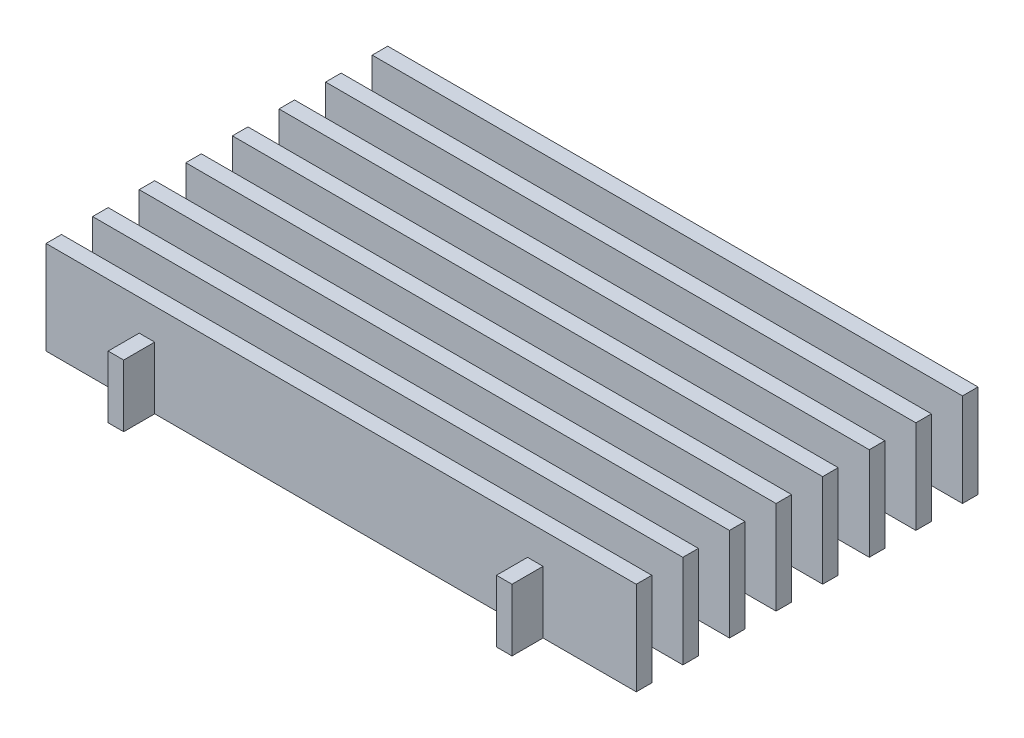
ISO-10303-21;
HEADER;
FILE_DESCRIPTION(('STEP AP214'),'2;1');
FILE_NAME('part.step','',(''),(''),'','','');
FILE_SCHEMA(('AUTOMOTIVE_DESIGN { 1 0 10303 214 1 1 1 1 }'));
ENDSEC;
DATA;
#1=APPLICATION_CONTEXT('core data for automotive mechanical design processes');
#2=APPLICATION_PROTOCOL_DEFINITION('international standard','automotive_design',2000,#1);
#3=PRODUCT_CONTEXT('',#1,'mechanical');
#4=PRODUCT('Part','Part','',(#3));
#5=PRODUCT_RELATED_PRODUCT_CATEGORY('part','',(#4));
#6=PRODUCT_DEFINITION_FORMATION('','',#4);
#7=PRODUCT_DEFINITION_CONTEXT('part definition',#1,'design');
#8=PRODUCT_DEFINITION('design','',#6,#7);
#9=PRODUCT_DEFINITION_SHAPE('','',#8);
#10=(LENGTH_UNIT() NAMED_UNIT(*) SI_UNIT(.MILLI.,.METRE.));
#11=(NAMED_UNIT(*) PLANE_ANGLE_UNIT() SI_UNIT($,.RADIAN.));
#12=(NAMED_UNIT(*) SI_UNIT($,.STERADIAN.) SOLID_ANGLE_UNIT());
#13=UNCERTAINTY_MEASURE_WITH_UNIT(LENGTH_MEASURE(1.E-05),#10,'distance_accuracy_value','');
#14=(GEOMETRIC_REPRESENTATION_CONTEXT(3) GLOBAL_UNCERTAINTY_ASSIGNED_CONTEXT((#13)) GLOBAL_UNIT_ASSIGNED_CONTEXT((#10,
#11,#12)) REPRESENTATION_CONTEXT('',''));
#15=CARTESIAN_POINT('',(0.,0.,0.));
#16=DIRECTION('',(0.,0.,1.));
#17=DIRECTION('',(1.,0.,0.));
#18=AXIS2_PLACEMENT_3D('',#15,#16,#17);
#19=CARTESIAN_POINT('',(0.,3.175,0.));
#20=DIRECTION('',(0.,-1.,0.));
#21=DIRECTION('',(0.,0.,-1.));
#22=AXIS2_PLACEMENT_3D('',#19,#20,#21);
#23=PLANE('',#22);
#24=DIRECTION('',(1.,0.,0.));
#25=VECTOR('',#24,1.);
#26=CARTESIAN_POINT('',(0.,3.175,-31.75));
#27=LINE('',#26,#25);
#28=CARTESIAN_POINT('',(-41.275,3.175,-31.75));
#29=VERTEX_POINT('',#28);
#30=CARTESIAN_POINT('',(-38.1,3.175,-31.75));
#31=VERTEX_POINT('',#30);
#32=EDGE_CURVE('E888',#29,#31,#27,.T.);
#33=ORIENTED_EDGE('',*,*,#32,.F.);
#34=DIRECTION('',(0.,0.,-1.));
#35=VECTOR('',#34,1.);
#36=CARTESIAN_POINT('',(-41.275,3.175,-41.275));
#37=LINE('',#36,#35);
#38=CARTESIAN_POINT('',(-41.275,3.175,-25.4));
#39=VERTEX_POINT('',#38);
#40=EDGE_CURVE('E1426',#39,#29,#37,.T.);
#41=ORIENTED_EDGE('',*,*,#40,.F.);
#42=DIRECTION('',(-1.,0.,0.));
#43=VECTOR('',#42,1.);
#44=CARTESIAN_POINT('',(0.,3.175,-25.4));
#45=LINE('',#44,#43);
#46=CARTESIAN_POINT('',(-38.1,3.175,-25.4));
#47=VERTEX_POINT('',#46);
#48=EDGE_CURVE('E929',#47,#39,#45,.T.);
#49=ORIENTED_EDGE('',*,*,#48,.F.);
#50=DIRECTION('',(0.,0.,1.));
#51=VECTOR('',#50,1.);
#52=CARTESIAN_POINT('',(-38.1,3.175,-41.275));
#53=LINE('',#52,#51);
#54=EDGE_CURVE('E1195',#31,#47,#53,.T.);
#55=ORIENTED_EDGE('',*,*,#54,.F.);
#56=EDGE_LOOP('',(#33,#41,#49,#55));
#57=FACE_BOUND('',#56,.T.);
#58=ADVANCED_FACE('F32',(#57),#23,.F.);
#59=DIRECTION('',(-1.,0.,0.));
#60=VECTOR('',#59,1.);
#61=CARTESIAN_POINT('',(0.,3.175,-34.925));
#62=LINE('',#61,#60);
#63=CARTESIAN_POINT('',(-38.1,3.175,-34.925));
#64=VERTEX_POINT('',#63);
#65=CARTESIAN_POINT('',(-41.275,3.175,-34.925));
#66=VERTEX_POINT('',#65);
#67=EDGE_CURVE('E880',#64,#66,#62,.T.);
#68=ORIENTED_EDGE('',*,*,#67,.F.);
#69=CARTESIAN_POINT('',(-38.1,3.175,-41.275));
#70=VERTEX_POINT('',#69);
#71=EDGE_CURVE('E1191',#70,#64,#53,.T.);
#72=ORIENTED_EDGE('',*,*,#71,.F.);
#73=DIRECTION('',(1.,0.,0.));
#74=VECTOR('',#73,1.);
#75=CARTESIAN_POINT('',(-38.1,3.175,-41.275));
#76=LINE('',#75,#74);
#77=CARTESIAN_POINT('',(-41.275,3.175,-41.275));
#78=VERTEX_POINT('',#77);
#79=EDGE_CURVE('E1185',#78,#70,#76,.T.);
#80=ORIENTED_EDGE('',*,*,#79,.F.);
#81=EDGE_CURVE('E1187',#66,#78,#37,.T.);
#82=ORIENTED_EDGE('',*,*,#81,.F.);
#83=EDGE_LOOP('',(#68,#72,#80,#82));
#84=FACE_BOUND('',#83,.T.);
#85=ADVANCED_FACE('F1425',(#84),#23,.F.);
#86=CARTESIAN_POINT('',(-41.275,3.175,-41.275));
#87=DIRECTION('',(-1.,0.,0.));
#88=DIRECTION('',(0.,0.,1.));
#89=AXIS2_PLACEMENT_3D('',#86,#87,#88);
#90=PLANE('',#89);
#91=ORIENTED_EDGE('',*,*,#40,.T.);
#92=DIRECTION('',(0.,-1.,0.));
#93=VECTOR('',#92,1.);
#94=CARTESIAN_POINT('',(-41.275,3.175,-31.75));
#95=LINE('',#94,#93);
#96=CARTESIAN_POINT('',(-41.275,-9.525,-31.75));
#97=VERTEX_POINT('',#96);
#98=EDGE_CURVE('E890',#29,#97,#95,.T.);
#99=ORIENTED_EDGE('',*,*,#98,.T.);
#100=DIRECTION('',(0.,0.,-1.));
#101=VECTOR('',#100,1.);
#102=CARTESIAN_POINT('',(-41.275,-9.525,-41.275));
#103=LINE('',#102,#101);
#104=CARTESIAN_POINT('',(-41.275,-9.525,-25.4));
#105=VERTEX_POINT('',#104);
#106=EDGE_CURVE('E1404',#105,#97,#103,.T.);
#107=ORIENTED_EDGE('',*,*,#106,.F.);
#108=DIRECTION('',(0.,1.,0.));
#109=VECTOR('',#108,1.);
#110=CARTESIAN_POINT('',(-41.275,3.175,-25.4));
#111=LINE('',#110,#109);
#112=EDGE_CURVE('E931',#105,#39,#111,.T.);
#113=ORIENTED_EDGE('',*,*,#112,.T.);
#114=EDGE_LOOP('',(#91,#99,#107,#113));
#115=FACE_BOUND('',#114,.T.);
#116=ADVANCED_FACE('F1620',(#115),#90,.T.);
#117=CARTESIAN_POINT('',(-41.275,-9.525,-34.925));
#118=VERTEX_POINT('',#117);
#119=CARTESIAN_POINT('',(-41.275,-9.525,-41.275));
#120=VERTEX_POINT('',#119);
#121=EDGE_CURVE('E1181',#118,#120,#103,.T.);
#122=ORIENTED_EDGE('',*,*,#121,.F.);
#123=DIRECTION('',(0.,1.,0.));
#124=VECTOR('',#123,1.);
#125=CARTESIAN_POINT('',(-41.275,3.175,-34.925));
#126=LINE('',#125,#124);
#127=EDGE_CURVE('E882',#118,#66,#126,.T.);
#128=ORIENTED_EDGE('',*,*,#127,.T.);
#129=ORIENTED_EDGE('',*,*,#81,.T.);
#130=DIRECTION('',(0.,-1.,0.));
#131=VECTOR('',#130,1.);
#132=CARTESIAN_POINT('',(-41.275,3.175,-41.275));
#133=LINE('',#132,#131);
#134=EDGE_CURVE('E1198',#78,#120,#133,.T.);
#135=ORIENTED_EDGE('',*,*,#134,.T.);
#136=EDGE_LOOP('',(#122,#128,#129,#135));
#137=FACE_BOUND('',#136,.T.);
#138=ADVANCED_FACE('F1414',(#137),#90,.T.);
#139=CARTESIAN_POINT('',(-38.1,3.175,-41.275));
#140=DIRECTION('',(1.,0.,0.));
#141=DIRECTION('',(0.,0.,-1.));
#142=AXIS2_PLACEMENT_3D('',#139,#140,#141);
#143=PLANE('',#142);
#144=DIRECTION('',(0.,0.,1.));
#145=VECTOR('',#144,1.);
#146=CARTESIAN_POINT('',(-38.1,-9.525,-41.275));
#147=LINE('',#146,#145);
#148=CARTESIAN_POINT('',(-38.1,-9.525,-31.75));
#149=VERTEX_POINT('',#148);
#150=CARTESIAN_POINT('',(-38.1,-9.525,-25.4));
#151=VERTEX_POINT('',#150);
#152=EDGE_CURVE('E1211',#149,#151,#147,.T.);
#153=ORIENTED_EDGE('',*,*,#152,.F.);
#154=DIRECTION('',(0.,1.,0.));
#155=VECTOR('',#154,1.);
#156=CARTESIAN_POINT('',(-38.1,3.175,-31.75));
#157=LINE('',#156,#155);
#158=EDGE_CURVE('E885',#149,#31,#157,.T.);
#159=ORIENTED_EDGE('',*,*,#158,.T.);
#160=ORIENTED_EDGE('',*,*,#54,.T.);
#161=DIRECTION('',(0.,-1.,0.));
#162=VECTOR('',#161,1.);
#163=CARTESIAN_POINT('',(-38.1,3.175,-25.4));
#164=LINE('',#163,#162);
#165=EDGE_CURVE('E926',#47,#151,#164,.T.);
#166=ORIENTED_EDGE('',*,*,#165,.T.);
#167=EDGE_LOOP('',(#153,#159,#160,#166));
#168=FACE_BOUND('',#167,.T.);
#169=ADVANCED_FACE('F1679',(#168),#143,.T.);
#170=ORIENTED_EDGE('',*,*,#71,.T.);
#171=DIRECTION('',(0.,-1.,0.));
#172=VECTOR('',#171,1.);
#173=CARTESIAN_POINT('',(-38.1,3.175,-34.925));
#174=LINE('',#173,#172);
#175=CARTESIAN_POINT('',(-38.1,-9.525,-34.925));
#176=VERTEX_POINT('',#175);
#177=EDGE_CURVE('E877',#64,#176,#174,.T.);
#178=ORIENTED_EDGE('',*,*,#177,.T.);
#179=CARTESIAN_POINT('',(-38.1,-9.525,-41.275));
#180=VERTEX_POINT('',#179);
#181=EDGE_CURVE('E1207',#180,#176,#147,.T.);
#182=ORIENTED_EDGE('',*,*,#181,.F.);
#183=DIRECTION('',(0.,-1.,0.));
#184=VECTOR('',#183,1.);
#185=CARTESIAN_POINT('',(-38.1,3.175,-41.275));
#186=LINE('',#185,#184);
#187=EDGE_CURVE('E1220',#70,#180,#186,.T.);
#188=ORIENTED_EDGE('',*,*,#187,.F.);
#189=EDGE_LOOP('',(#170,#178,#182,#188));
#190=FACE_BOUND('',#189,.T.);
#191=ADVANCED_FACE('F1422',(#190),#143,.T.);
#192=DIRECTION('',(1.,0.,0.));
#193=VECTOR('',#192,1.);
#194=CARTESIAN_POINT('',(0.,3.175,-22.225));
#195=LINE('',#194,#193);
#196=CARTESIAN_POINT('',(-41.275,3.175,-22.225));
#197=VERTEX_POINT('',#196);
#198=CARTESIAN_POINT('',(-38.1,3.175,-22.225));
#199=VERTEX_POINT('',#198);
#200=EDGE_CURVE('E937',#197,#199,#195,.T.);
#201=ORIENTED_EDGE('',*,*,#200,.F.);
#202=CARTESIAN_POINT('',(-41.275,3.175,-15.875));
#203=VERTEX_POINT('',#202);
#204=EDGE_CURVE('E1428',#203,#197,#37,.T.);
#205=ORIENTED_EDGE('',*,*,#204,.F.);
#206=DIRECTION('',(-1.,0.,0.));
#207=VECTOR('',#206,1.);
#208=CARTESIAN_POINT('',(0.,3.175,-15.875));
#209=LINE('',#208,#207);
#210=CARTESIAN_POINT('',(-38.1,3.175,-15.875));
#211=VERTEX_POINT('',#210);
#212=EDGE_CURVE('E978',#211,#203,#209,.T.);
#213=ORIENTED_EDGE('',*,*,#212,.F.);
#214=EDGE_CURVE('E1531',#199,#211,#53,.T.);
#215=ORIENTED_EDGE('',*,*,#214,.F.);
#216=EDGE_LOOP('',(#201,#205,#213,#215));
#217=FACE_BOUND('',#216,.T.);
#218=ADVANCED_FACE('F1621',(#217),#23,.F.);
#219=ORIENTED_EDGE('',*,*,#204,.T.);
#220=DIRECTION('',(0.,-1.,0.));
#221=VECTOR('',#220,1.);
#222=CARTESIAN_POINT('',(-41.275,3.175,-22.225));
#223=LINE('',#222,#221);
#224=CARTESIAN_POINT('',(-41.275,-9.525,-22.225));
#225=VERTEX_POINT('',#224);
#226=EDGE_CURVE('E939',#197,#225,#223,.T.);
#227=ORIENTED_EDGE('',*,*,#226,.T.);
#228=CARTESIAN_POINT('',(-41.275,-9.525,-15.875));
#229=VERTEX_POINT('',#228);
#230=EDGE_CURVE('E1407',#229,#225,#103,.T.);
#231=ORIENTED_EDGE('',*,*,#230,.F.);
#232=DIRECTION('',(0.,1.,0.));
#233=VECTOR('',#232,1.);
#234=CARTESIAN_POINT('',(-41.275,3.175,-15.875));
#235=LINE('',#234,#233);
#236=EDGE_CURVE('E980',#229,#203,#235,.T.);
#237=ORIENTED_EDGE('',*,*,#236,.T.);
#238=EDGE_LOOP('',(#219,#227,#231,#237));
#239=FACE_BOUND('',#238,.T.);
#240=ADVANCED_FACE('F1671',(#239),#90,.T.);
#241=CARTESIAN_POINT('',(-38.1,-9.525,-22.225));
#242=VERTEX_POINT('',#241);
#243=CARTESIAN_POINT('',(-38.1,-9.525,-15.875));
#244=VERTEX_POINT('',#243);
#245=EDGE_CURVE('E1689',#242,#244,#147,.T.);
#246=ORIENTED_EDGE('',*,*,#245,.F.);
#247=DIRECTION('',(0.,1.,0.));
#248=VECTOR('',#247,1.);
#249=CARTESIAN_POINT('',(-38.1,3.175,-22.225));
#250=LINE('',#249,#248);
#251=EDGE_CURVE('E934',#242,#199,#250,.T.);
#252=ORIENTED_EDGE('',*,*,#251,.T.);
#253=ORIENTED_EDGE('',*,*,#214,.T.);
#254=DIRECTION('',(0.,-1.,0.));
#255=VECTOR('',#254,1.);
#256=CARTESIAN_POINT('',(-38.1,3.175,-15.875));
#257=LINE('',#256,#255);
#258=EDGE_CURVE('E975',#211,#244,#257,.T.);
#259=ORIENTED_EDGE('',*,*,#258,.T.);
#260=EDGE_LOOP('',(#246,#252,#253,#259));
#261=FACE_BOUND('',#260,.T.);
#262=ADVANCED_FACE('F1664',(#261),#143,.T.);
#263=DIRECTION('',(1.,0.,0.));
#264=VECTOR('',#263,1.);
#265=CARTESIAN_POINT('',(0.,3.175,-12.7));
#266=LINE('',#265,#264);
#267=CARTESIAN_POINT('',(-41.275,3.175,-12.7));
#268=VERTEX_POINT('',#267);
#269=CARTESIAN_POINT('',(-38.1,3.175,-12.7));
#270=VERTEX_POINT('',#269);
#271=EDGE_CURVE('E986',#268,#270,#266,.T.);
#272=ORIENTED_EDGE('',*,*,#271,.F.);
#273=CARTESIAN_POINT('',(-41.275,3.175,-6.34999999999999));
#274=VERTEX_POINT('',#273);
#275=EDGE_CURVE('E1431',#274,#268,#37,.T.);
#276=ORIENTED_EDGE('',*,*,#275,.F.);
#277=DIRECTION('',(-1.,0.,0.));
#278=VECTOR('',#277,1.);
#279=CARTESIAN_POINT('',(0.,3.175,-6.34999999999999));
#280=LINE('',#279,#278);
#281=CARTESIAN_POINT('',(-38.1,3.175,-6.34999999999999));
#282=VERTEX_POINT('',#281);
#283=EDGE_CURVE('E1027',#282,#274,#280,.T.);
#284=ORIENTED_EDGE('',*,*,#283,.F.);
#285=EDGE_CURVE('E1528',#270,#282,#53,.T.);
#286=ORIENTED_EDGE('',*,*,#285,.F.);
#287=EDGE_LOOP('',(#272,#276,#284,#286));
#288=FACE_BOUND('',#287,.T.);
#289=ADVANCED_FACE('F1526',(#288),#23,.F.);
#290=ORIENTED_EDGE('',*,*,#275,.T.);
#291=DIRECTION('',(0.,-1.,0.));
#292=VECTOR('',#291,1.);
#293=CARTESIAN_POINT('',(-41.275,3.175,-12.7));
#294=LINE('',#293,#292);
#295=CARTESIAN_POINT('',(-41.275,-9.525,-12.7));
#296=VERTEX_POINT('',#295);
#297=EDGE_CURVE('E988',#268,#296,#294,.T.);
#298=ORIENTED_EDGE('',*,*,#297,.T.);
#299=CARTESIAN_POINT('',(-41.275,-9.525,-6.34999999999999));
#300=VERTEX_POINT('',#299);
#301=EDGE_CURVE('E1409',#300,#296,#103,.T.);
#302=ORIENTED_EDGE('',*,*,#301,.F.);
#303=DIRECTION('',(0.,1.,0.));
#304=VECTOR('',#303,1.);
#305=CARTESIAN_POINT('',(-41.275,3.175,-6.34999999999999));
#306=LINE('',#305,#304);
#307=EDGE_CURVE('E1029',#300,#274,#306,.T.);
#308=ORIENTED_EDGE('',*,*,#307,.T.);
#309=EDGE_LOOP('',(#290,#298,#302,#308));
#310=FACE_BOUND('',#309,.T.);
#311=ADVANCED_FACE('F1519',(#310),#90,.T.);
#312=CARTESIAN_POINT('',(-38.1,-9.525,-12.7));
#313=VERTEX_POINT('',#312);
#314=CARTESIAN_POINT('',(-38.1,-9.525,-6.34999999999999));
#315=VERTEX_POINT('',#314);
#316=EDGE_CURVE('E1690',#313,#315,#147,.T.);
#317=ORIENTED_EDGE('',*,*,#316,.F.);
#318=DIRECTION('',(0.,1.,0.));
#319=VECTOR('',#318,1.);
#320=CARTESIAN_POINT('',(-38.1,3.175,-12.7));
#321=LINE('',#320,#319);
#322=EDGE_CURVE('E983',#313,#270,#321,.T.);
#323=ORIENTED_EDGE('',*,*,#322,.T.);
#324=ORIENTED_EDGE('',*,*,#285,.T.);
#325=DIRECTION('',(0.,-1.,0.));
#326=VECTOR('',#325,1.);
#327=CARTESIAN_POINT('',(-38.1,3.175,-6.34999999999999));
#328=LINE('',#327,#326);
#329=EDGE_CURVE('E1024',#282,#315,#328,.T.);
#330=ORIENTED_EDGE('',*,*,#329,.T.);
#331=EDGE_LOOP('',(#317,#323,#324,#330));
#332=FACE_BOUND('',#331,.T.);
#333=ADVANCED_FACE('F1656',(#332),#143,.T.);
#334=DIRECTION('',(1.,0.,0.));
#335=VECTOR('',#334,1.);
#336=CARTESIAN_POINT('',(0.,3.175,-3.175));
#337=LINE('',#336,#335);
#338=CARTESIAN_POINT('',(-41.275,3.175,-3.175));
#339=VERTEX_POINT('',#338);
#340=CARTESIAN_POINT('',(-38.1,3.175,-3.175));
#341=VERTEX_POINT('',#340);
#342=EDGE_CURVE('E1035',#339,#341,#337,.T.);
#343=ORIENTED_EDGE('',*,*,#342,.F.);
#344=CARTESIAN_POINT('',(-41.275,3.175,3.175));
#345=VERTEX_POINT('',#344);
#346=EDGE_CURVE('E1435',#345,#339,#37,.T.);
#347=ORIENTED_EDGE('',*,*,#346,.F.);
#348=DIRECTION('',(-1.,0.,0.));
#349=VECTOR('',#348,1.);
#350=CARTESIAN_POINT('',(0.,3.175,3.175));
#351=LINE('',#350,#349);
#352=CARTESIAN_POINT('',(-38.1,3.175,3.175));
#353=VERTEX_POINT('',#352);
#354=EDGE_CURVE('E1076',#353,#345,#351,.T.);
#355=ORIENTED_EDGE('',*,*,#354,.F.);
#356=EDGE_CURVE('E1532',#341,#353,#53,.T.);
#357=ORIENTED_EDGE('',*,*,#356,.F.);
#358=EDGE_LOOP('',(#343,#347,#355,#357));
#359=FACE_BOUND('',#358,.T.);
#360=ADVANCED_FACE('F1650',(#359),#23,.F.);
#361=ORIENTED_EDGE('',*,*,#346,.T.);
#362=DIRECTION('',(0.,-1.,0.));
#363=VECTOR('',#362,1.);
#364=CARTESIAN_POINT('',(-41.275,3.175,-3.175));
#365=LINE('',#364,#363);
#366=CARTESIAN_POINT('',(-41.275,-9.525,-3.175));
#367=VERTEX_POINT('',#366);
#368=EDGE_CURVE('E1037',#339,#367,#365,.T.);
#369=ORIENTED_EDGE('',*,*,#368,.T.);
#370=CARTESIAN_POINT('',(-41.275,-9.525,3.175));
#371=VERTEX_POINT('',#370);
#372=EDGE_CURVE('E1505',#371,#367,#103,.T.);
#373=ORIENTED_EDGE('',*,*,#372,.F.);
#374=DIRECTION('',(0.,1.,0.));
#375=VECTOR('',#374,1.);
#376=CARTESIAN_POINT('',(-41.275,3.175,3.175));
#377=LINE('',#376,#375);
#378=EDGE_CURVE('E1078',#371,#345,#377,.T.);
#379=ORIENTED_EDGE('',*,*,#378,.T.);
#380=EDGE_LOOP('',(#361,#369,#373,#379));
#381=FACE_BOUND('',#380,.T.);
#382=ADVANCED_FACE('F1655',(#381),#90,.T.);
#383=CARTESIAN_POINT('',(-38.1,-9.525,-3.175));
#384=VERTEX_POINT('',#383);
#385=CARTESIAN_POINT('',(-38.1,-9.525,3.175));
#386=VERTEX_POINT('',#385);
#387=EDGE_CURVE('E1692',#384,#386,#147,.T.);
#388=ORIENTED_EDGE('',*,*,#387,.F.);
#389=DIRECTION('',(0.,1.,0.));
#390=VECTOR('',#389,1.);
#391=CARTESIAN_POINT('',(-38.1,3.175,-3.175));
#392=LINE('',#391,#390);
#393=EDGE_CURVE('E1032',#384,#341,#392,.T.);
#394=ORIENTED_EDGE('',*,*,#393,.T.);
#395=ORIENTED_EDGE('',*,*,#356,.T.);
#396=DIRECTION('',(0.,-1.,0.));
#397=VECTOR('',#396,1.);
#398=CARTESIAN_POINT('',(-38.1,3.175,3.175));
#399=LINE('',#398,#397);
#400=EDGE_CURVE('E1073',#353,#386,#399,.T.);
#401=ORIENTED_EDGE('',*,*,#400,.T.);
#402=EDGE_LOOP('',(#388,#394,#395,#401));
#403=FACE_BOUND('',#402,.T.);
#404=ADVANCED_FACE('F1647',(#403),#143,.T.);
#405=DIRECTION('',(1.,0.,0.));
#406=VECTOR('',#405,1.);
#407=CARTESIAN_POINT('',(0.,3.175,6.35));
#408=LINE('',#407,#406);
#409=CARTESIAN_POINT('',(-41.275,3.175,6.35));
#410=VERTEX_POINT('',#409);
#411=CARTESIAN_POINT('',(-38.1,3.175,6.35));
#412=VERTEX_POINT('',#411);
#413=EDGE_CURVE('E1084',#410,#412,#408,.T.);
#414=ORIENTED_EDGE('',*,*,#413,.F.);
#415=CARTESIAN_POINT('',(-41.275,3.175,12.7));
#416=VERTEX_POINT('',#415);
#417=EDGE_CURVE('E1439',#416,#410,#37,.T.);
#418=ORIENTED_EDGE('',*,*,#417,.F.);
#419=DIRECTION('',(-1.,0.,0.));
#420=VECTOR('',#419,1.);
#421=CARTESIAN_POINT('',(0.,3.175,12.7));
#422=LINE('',#421,#420);
#423=CARTESIAN_POINT('',(-38.1,3.175,12.7));
#424=VERTEX_POINT('',#423);
#425=EDGE_CURVE('E1125',#424,#416,#422,.T.);
#426=ORIENTED_EDGE('',*,*,#425,.F.);
#427=EDGE_CURVE('E1533',#412,#424,#53,.T.);
#428=ORIENTED_EDGE('',*,*,#427,.F.);
#429=EDGE_LOOP('',(#414,#418,#426,#428));
#430=FACE_BOUND('',#429,.T.);
#431=ADVANCED_FACE('F1641',(#430),#23,.F.);
#432=ORIENTED_EDGE('',*,*,#417,.T.);
#433=DIRECTION('',(0.,-1.,0.));
#434=VECTOR('',#433,1.);
#435=CARTESIAN_POINT('',(-41.275,3.175,6.35));
#436=LINE('',#435,#434);
#437=CARTESIAN_POINT('',(-41.275,-9.525,6.35));
#438=VERTEX_POINT('',#437);
#439=EDGE_CURVE('E1086',#410,#438,#436,.T.);
#440=ORIENTED_EDGE('',*,*,#439,.T.);
#441=CARTESIAN_POINT('',(-41.275,-9.525,12.7));
#442=VERTEX_POINT('',#441);
#443=EDGE_CURVE('E1500',#442,#438,#103,.T.);
#444=ORIENTED_EDGE('',*,*,#443,.F.);
#445=DIRECTION('',(0.,1.,0.));
#446=VECTOR('',#445,1.);
#447=CARTESIAN_POINT('',(-41.275,3.175,12.7));
#448=LINE('',#447,#446);
#449=EDGE_CURVE('E1127',#442,#416,#448,.T.);
#450=ORIENTED_EDGE('',*,*,#449,.T.);
#451=EDGE_LOOP('',(#432,#440,#444,#450));
#452=FACE_BOUND('',#451,.T.);
#453=ADVANCED_FACE('F1646',(#452),#90,.T.);
#454=CARTESIAN_POINT('',(-38.1,-9.525,6.35));
#455=VERTEX_POINT('',#454);
#456=CARTESIAN_POINT('',(-38.1,-9.525,12.7));
#457=VERTEX_POINT('',#456);
#458=EDGE_CURVE('E1468',#455,#457,#147,.T.);
#459=ORIENTED_EDGE('',*,*,#458,.F.);
#460=DIRECTION('',(0.,1.,0.));
#461=VECTOR('',#460,1.);
#462=CARTESIAN_POINT('',(-38.1,3.175,6.35));
#463=LINE('',#462,#461);
#464=EDGE_CURVE('E1081',#455,#412,#463,.T.);
#465=ORIENTED_EDGE('',*,*,#464,.T.);
#466=ORIENTED_EDGE('',*,*,#427,.T.);
#467=DIRECTION('',(0.,-1.,0.));
#468=VECTOR('',#467,1.);
#469=CARTESIAN_POINT('',(-38.1,3.175,12.7));
#470=LINE('',#469,#468);
#471=EDGE_CURVE('E1122',#424,#457,#470,.T.);
#472=ORIENTED_EDGE('',*,*,#471,.T.);
#473=EDGE_LOOP('',(#459,#465,#466,#472));
#474=FACE_BOUND('',#473,.T.);
#475=ADVANCED_FACE('F1633',(#474),#143,.T.);
#476=DIRECTION('',(1.,0.,0.));
#477=VECTOR('',#476,1.);
#478=CARTESIAN_POINT('',(0.,3.175,15.875));
#479=LINE('',#478,#477);
#480=CARTESIAN_POINT('',(-41.275,3.175,15.875));
#481=VERTEX_POINT('',#480);
#482=CARTESIAN_POINT('',(-38.1,3.175,15.875));
#483=VERTEX_POINT('',#482);
#484=EDGE_CURVE('E1133',#481,#483,#479,.T.);
#485=ORIENTED_EDGE('',*,*,#484,.F.);
#486=CARTESIAN_POINT('',(-41.275,3.175,22.225));
#487=VERTEX_POINT('',#486);
#488=EDGE_CURVE('E1443',#487,#481,#37,.T.);
#489=ORIENTED_EDGE('',*,*,#488,.F.);
#490=DIRECTION('',(-1.,0.,0.));
#491=VECTOR('',#490,1.);
#492=CARTESIAN_POINT('',(0.,3.175,22.225));
#493=LINE('',#492,#491);
#494=CARTESIAN_POINT('',(-38.1,3.175,22.225));
#495=VERTEX_POINT('',#494);
#496=EDGE_CURVE('E1171',#495,#487,#493,.T.);
#497=ORIENTED_EDGE('',*,*,#496,.F.);
#498=EDGE_CURVE('E1537',#483,#495,#53,.T.);
#499=ORIENTED_EDGE('',*,*,#498,.F.);
#500=EDGE_LOOP('',(#485,#489,#497,#499));
#501=FACE_BOUND('',#500,.T.);
#502=ADVANCED_FACE('F1552',(#501),#23,.F.);
#503=ORIENTED_EDGE('',*,*,#488,.T.);
#504=DIRECTION('',(0.,-1.,0.));
#505=VECTOR('',#504,1.);
#506=CARTESIAN_POINT('',(-41.275,3.175,15.875));
#507=LINE('',#506,#505);
#508=CARTESIAN_POINT('',(-41.275,-9.525,15.875));
#509=VERTEX_POINT('',#508);
#510=EDGE_CURVE('E1135',#481,#509,#507,.T.);
#511=ORIENTED_EDGE('',*,*,#510,.T.);
#512=CARTESIAN_POINT('',(-41.275,-9.525,22.225));
#513=VERTEX_POINT('',#512);
#514=EDGE_CURVE('E1498',#513,#509,#103,.T.);
#515=ORIENTED_EDGE('',*,*,#514,.F.);
#516=DIRECTION('',(0.,1.,0.));
#517=VECTOR('',#516,1.);
#518=CARTESIAN_POINT('',(-41.275,3.175,22.225));
#519=LINE('',#518,#517);
#520=EDGE_CURVE('E1173',#513,#487,#519,.T.);
#521=ORIENTED_EDGE('',*,*,#520,.T.);
#522=EDGE_LOOP('',(#503,#511,#515,#521));
#523=FACE_BOUND('',#522,.T.);
#524=ADVANCED_FACE('F1555',(#523),#90,.T.);
#525=CARTESIAN_POINT('',(-38.1,-9.525,15.875));
#526=VERTEX_POINT('',#525);
#527=CARTESIAN_POINT('',(-38.1,-9.525,22.225));
#528=VERTEX_POINT('',#527);
#529=EDGE_CURVE('E1466',#526,#528,#147,.T.);
#530=ORIENTED_EDGE('',*,*,#529,.F.);
#531=DIRECTION('',(0.,1.,0.));
#532=VECTOR('',#531,1.);
#533=CARTESIAN_POINT('',(-38.1,3.175,15.875));
#534=LINE('',#533,#532);
#535=EDGE_CURVE('E1130',#526,#483,#534,.T.);
#536=ORIENTED_EDGE('',*,*,#535,.T.);
#537=ORIENTED_EDGE('',*,*,#498,.T.);
#538=DIRECTION('',(0.,-1.,0.));
#539=VECTOR('',#538,1.);
#540=CARTESIAN_POINT('',(-38.1,3.175,22.225));
#541=LINE('',#540,#539);
#542=EDGE_CURVE('E1274',#495,#528,#541,.T.);
#543=ORIENTED_EDGE('',*,*,#542,.T.);
#544=EDGE_LOOP('',(#530,#536,#537,#543));
#545=FACE_BOUND('',#544,.T.);
#546=ADVANCED_FACE('F1545',(#545),#143,.T.);
#547=DIRECTION('',(1.,0.,0.));
#548=VECTOR('',#547,1.);
#549=CARTESIAN_POINT('',(0.,3.175,25.4));
#550=LINE('',#549,#548);
#551=CARTESIAN_POINT('',(-41.275,3.175,25.4));
#552=VERTEX_POINT('',#551);
#553=CARTESIAN_POINT('',(-38.1,3.175,25.4));
#554=VERTEX_POINT('',#553);
#555=EDGE_CURVE('E1176',#552,#554,#550,.T.);
#556=ORIENTED_EDGE('',*,*,#555,.F.);
#557=CARTESIAN_POINT('',(-41.275,3.175,31.75));
#558=VERTEX_POINT('',#557);
#559=EDGE_CURVE('E1186',#558,#552,#37,.T.);
#560=ORIENTED_EDGE('',*,*,#559,.F.);
#561=DIRECTION('',(1.,0.,0.));
#562=VECTOR('',#561,1.);
#563=CARTESIAN_POINT('',(-60.325,3.175,31.75));
#564=LINE('',#563,#562);
#565=CARTESIAN_POINT('',(-38.1,3.175,31.75));
#566=VERTEX_POINT('',#565);
#567=EDGE_CURVE('E1234',#558,#566,#564,.T.);
#568=ORIENTED_EDGE('',*,*,#567,.T.);
#569=EDGE_CURVE('E1460',#554,#566,#53,.T.);
#570=ORIENTED_EDGE('',*,*,#569,.F.);
#571=EDGE_LOOP('',(#556,#560,#568,#570));
#572=FACE_BOUND('',#571,.T.);
#573=ADVANCED_FACE('F1458',(#572),#23,.F.);
#574=ORIENTED_EDGE('',*,*,#559,.T.);
#575=DIRECTION('',(0.,-1.,0.));
#576=VECTOR('',#575,1.);
#577=CARTESIAN_POINT('',(-41.275,3.175,25.4));
#578=LINE('',#577,#576);
#579=CARTESIAN_POINT('',(-41.275,-9.525,25.4));
#580=VERTEX_POINT('',#579);
#581=EDGE_CURVE('E1178',#552,#580,#578,.T.);
#582=ORIENTED_EDGE('',*,*,#581,.T.);
#583=CARTESIAN_POINT('',(-41.275,-9.525,31.75));
#584=VERTEX_POINT('',#583);
#585=EDGE_CURVE('E1203',#584,#580,#103,.T.);
#586=ORIENTED_EDGE('',*,*,#585,.F.);
#587=DIRECTION('',(0.,-1.,0.));
#588=VECTOR('',#587,1.);
#589=CARTESIAN_POINT('',(-41.275,9.525,31.75));
#590=LINE('',#589,#588);
#591=EDGE_CURVE('E1231',#558,#584,#590,.T.);
#592=ORIENTED_EDGE('',*,*,#591,.F.);
#593=EDGE_LOOP('',(#574,#582,#586,#592));
#594=FACE_BOUND('',#593,.T.);
#595=ADVANCED_FACE('F1453',(#594),#90,.T.);
#596=CARTESIAN_POINT('',(-38.1,-9.525,25.4));
#597=VERTEX_POINT('',#596);
#598=CARTESIAN_POINT('',(-38.1,-9.525,31.75));
#599=VERTEX_POINT('',#598);
#600=EDGE_CURVE('E1465',#597,#599,#147,.T.);
#601=ORIENTED_EDGE('',*,*,#600,.F.);
#602=DIRECTION('',(0.,1.,0.));
#603=VECTOR('',#602,1.);
#604=CARTESIAN_POINT('',(-38.1,3.175,25.4));
#605=LINE('',#604,#603);
#606=EDGE_CURVE('E1277',#597,#554,#605,.T.);
#607=ORIENTED_EDGE('',*,*,#606,.T.);
#608=ORIENTED_EDGE('',*,*,#569,.T.);
#609=DIRECTION('',(0.,1.,0.));
#610=VECTOR('',#609,1.);
#611=CARTESIAN_POINT('',(-38.1,9.525,31.75));
#612=LINE('',#611,#610);
#613=EDGE_CURVE('E1226',#599,#566,#612,.T.);
#614=ORIENTED_EDGE('',*,*,#613,.F.);
#615=EDGE_LOOP('',(#601,#607,#608,#614));
#616=FACE_BOUND('',#615,.T.);
#617=ADVANCED_FACE('F1463',(#616),#143,.T.);
#618=CARTESIAN_POINT('',(60.325,9.525,31.75));
#619=DIRECTION('',(-1.,0.,0.));
#620=DIRECTION('',(0.,0.,1.));
#621=AXIS2_PLACEMENT_3D('',#618,#619,#620);
#622=PLANE('',#621);
#623=DIRECTION('',(0.,0.,-1.));
#624=VECTOR('',#623,1.);
#625=CARTESIAN_POINT('',(60.325,-9.525,31.75));
#626=LINE('',#625,#624);
#627=CARTESIAN_POINT('',(60.325,-9.525,34.925));
#628=VERTEX_POINT('',#627);
#629=CARTESIAN_POINT('',(60.325,-9.525,31.75));
#630=VERTEX_POINT('',#629);
#631=EDGE_CURVE('E1237',#628,#630,#626,.T.);
#632=ORIENTED_EDGE('',*,*,#631,.T.);
#633=DIRECTION('',(0.,-1.,0.));
#634=VECTOR('',#633,1.);
#635=CARTESIAN_POINT('',(60.325,9.525,31.75));
#636=LINE('',#635,#634);
#637=CARTESIAN_POINT('',(60.325,9.525,31.75));
#638=VERTEX_POINT('',#637);
#639=EDGE_CURVE('E1268',#638,#630,#636,.T.);
#640=ORIENTED_EDGE('',*,*,#639,.F.);
#641=DIRECTION('',(0.,0.,-1.));
#642=VECTOR('',#641,1.);
#643=CARTESIAN_POINT('',(60.325,9.525,31.75));
#644=LINE('',#643,#642);
#645=CARTESIAN_POINT('',(60.325,9.525,34.925));
#646=VERTEX_POINT('',#645);
#647=EDGE_CURVE('E1238',#646,#638,#644,.T.);
#648=ORIENTED_EDGE('',*,*,#647,.F.);
#649=DIRECTION('',(0.,-1.,0.));
#650=VECTOR('',#649,1.);
#651=CARTESIAN_POINT('',(60.325,9.525,34.925));
#652=LINE('',#651,#650);
#653=EDGE_CURVE('E1248',#646,#628,#652,.T.);
#654=ORIENTED_EDGE('',*,*,#653,.T.);
#655=EDGE_LOOP('',(#632,#640,#648,#654));
#656=FACE_BOUND('',#655,.T.);
#657=ADVANCED_FACE('F34',(#656),#622,.F.);
#658=CARTESIAN_POINT('',(-60.325,9.525,31.75));
#659=DIRECTION('',(0.,0.,1.));
#660=DIRECTION('',(1.,0.,0.));
#661=AXIS2_PLACEMENT_3D('',#658,#659,#660);
#662=PLANE('',#661);
#663=DIRECTION('',(1.,0.,0.));
#664=VECTOR('',#663,1.);
#665=CARTESIAN_POINT('',(-60.325,3.175,31.75));
#666=LINE('',#665,#664);
#667=CARTESIAN_POINT('',(38.1,3.175,31.75));
#668=VERTEX_POINT('',#667);
#669=CARTESIAN_POINT('',(41.275,3.175,31.75));
#670=VERTEX_POINT('',#669);
#671=EDGE_CURVE('E51',#668,#670,#666,.T.);
#672=ORIENTED_EDGE('',*,*,#671,.F.);
#673=DIRECTION('',(0.,-1.,0.));
#674=VECTOR('',#673,1.);
#675=CARTESIAN_POINT('',(38.1,9.525,31.75));
#676=LINE('',#675,#674);
#677=CARTESIAN_POINT('',(38.1,-9.525,31.75));
#678=VERTEX_POINT('',#677);
#679=EDGE_CURVE('E842',#668,#678,#676,.T.);
#680=ORIENTED_EDGE('',*,*,#679,.T.);
#681=DIRECTION('',(-1.,0.,0.));
#682=VECTOR('',#681,1.);
#683=CARTESIAN_POINT('',(-60.325,-9.525,31.75));
#684=LINE('',#683,#682);
#685=EDGE_CURVE('E1255',#678,#599,#684,.T.);
#686=ORIENTED_EDGE('',*,*,#685,.T.);
#687=ORIENTED_EDGE('',*,*,#613,.T.);
#688=ORIENTED_EDGE('',*,*,#567,.F.);
#689=ORIENTED_EDGE('',*,*,#591,.T.);
#690=CARTESIAN_POINT('',(-60.325,-9.525,31.75));
#691=VERTEX_POINT('',#690);
#692=EDGE_CURVE('E1251',#584,#691,#684,.T.);
#693=ORIENTED_EDGE('',*,*,#692,.T.);
#694=DIRECTION('',(0.,-1.,0.));
#695=VECTOR('',#694,1.);
#696=CARTESIAN_POINT('',(-60.325,9.525,31.75));
#697=LINE('',#696,#695);
#698=CARTESIAN_POINT('',(-60.325,9.525,31.75));
#699=VERTEX_POINT('',#698);
#700=EDGE_CURVE('E1265',#699,#691,#697,.T.);
#701=ORIENTED_EDGE('',*,*,#700,.F.);
#702=DIRECTION('',(-1.,0.,0.));
#703=VECTOR('',#702,1.);
#704=CARTESIAN_POINT('',(-60.325,9.525,31.75));
#705=LINE('',#704,#703);
#706=EDGE_CURVE('E1241',#638,#699,#705,.T.);
#707=ORIENTED_EDGE('',*,*,#706,.F.);
#708=ORIENTED_EDGE('',*,*,#639,.T.);
#709=CARTESIAN_POINT('',(41.275,-9.525,31.75));
#710=VERTEX_POINT('',#709);
#711=EDGE_CURVE('E1252',#630,#710,#684,.T.);
#712=ORIENTED_EDGE('',*,*,#711,.T.);
#713=DIRECTION('',(0.,1.,0.));
#714=VECTOR('',#713,1.);
#715=CARTESIAN_POINT('',(41.275,9.525,31.75));
#716=LINE('',#715,#714);
#717=EDGE_CURVE('E47',#710,#670,#716,.T.);
#718=ORIENTED_EDGE('',*,*,#717,.T.);
#719=EDGE_LOOP('',(#672,#680,#686,#687,#688,#689,#693,#701,#707,#708,#712,#718));
#720=FACE_BOUND('',#719,.T.);
#721=ADVANCED_FACE('F1495',(#720),#662,.F.);
#722=CARTESIAN_POINT('',(-60.325,9.525,31.75));
#723=DIRECTION('',(1.,0.,0.));
#724=DIRECTION('',(0.,0.,-1.));
#725=AXIS2_PLACEMENT_3D('',#722,#723,#724);
#726=PLANE('',#725);
#727=DIRECTION('',(0.,0.,1.));
#728=VECTOR('',#727,1.);
#729=CARTESIAN_POINT('',(-60.325,-9.525,31.75));
#730=LINE('',#729,#728);
#731=CARTESIAN_POINT('',(-60.325,-9.525,34.925));
#732=VERTEX_POINT('',#731);
#733=EDGE_CURVE('E1254',#691,#732,#730,.T.);
#734=ORIENTED_EDGE('',*,*,#733,.T.);
#735=DIRECTION('',(0.,-1.,0.));
#736=VECTOR('',#735,1.);
#737=CARTESIAN_POINT('',(-60.325,9.525,34.925));
#738=LINE('',#737,#736);
#739=CARTESIAN_POINT('',(-60.325,9.525,34.925));
#740=VERTEX_POINT('',#739);
#741=EDGE_CURVE('E1262',#740,#732,#738,.T.);
#742=ORIENTED_EDGE('',*,*,#741,.F.);
#743=DIRECTION('',(0.,0.,1.));
#744=VECTOR('',#743,1.);
#745=CARTESIAN_POINT('',(-60.325,9.525,31.75));
#746=LINE('',#745,#744);
#747=EDGE_CURVE('E1244',#699,#740,#746,.T.);
#748=ORIENTED_EDGE('',*,*,#747,.F.);
#749=ORIENTED_EDGE('',*,*,#700,.T.);
#750=EDGE_LOOP('',(#734,#742,#748,#749));
#751=FACE_BOUND('',#750,.T.);
#752=ADVANCED_FACE('F1493',(#751),#726,.F.);
#753=CARTESIAN_POINT('',(-60.325,9.525,34.925));
#754=DIRECTION('',(0.,0.,-1.));
#755=DIRECTION('',(-1.,0.,0.));
#756=AXIS2_PLACEMENT_3D('',#753,#754,#755);
#757=PLANE('',#756);
#758=DIRECTION('',(1.,0.,0.));
#759=VECTOR('',#758,1.);
#760=CARTESIAN_POINT('',(-60.325,-9.525,34.925));
#761=LINE('',#760,#759);
#762=CARTESIAN_POINT('',(-38.1,-9.525,34.925));
#763=VERTEX_POINT('',#762);
#764=CARTESIAN_POINT('',(38.1,-9.525,34.925));
#765=VERTEX_POINT('',#764);
#766=EDGE_CURVE('E1259',#763,#765,#761,.T.);
#767=ORIENTED_EDGE('',*,*,#766,.T.);
#768=DIRECTION('',(0.,1.,0.));
#769=VECTOR('',#768,1.);
#770=CARTESIAN_POINT('',(38.1,9.525,34.925));
#771=LINE('',#770,#769);
#772=CARTESIAN_POINT('',(38.1,3.175,34.925));
#773=VERTEX_POINT('',#772);
#774=EDGE_CURVE('E840',#765,#773,#771,.T.);
#775=ORIENTED_EDGE('',*,*,#774,.T.);
#776=DIRECTION('',(-1.,0.,0.));
#777=VECTOR('',#776,1.);
#778=CARTESIAN_POINT('',(-60.325,3.175,34.925));
#779=LINE('',#778,#777);
#780=CARTESIAN_POINT('',(41.275,3.175,34.925));
#781=VERTEX_POINT('',#780);
#782=EDGE_CURVE('E767',#781,#773,#779,.T.);
#783=ORIENTED_EDGE('',*,*,#782,.F.);
#784=DIRECTION('',(0.,-1.,0.));
#785=VECTOR('',#784,1.);
#786=CARTESIAN_POINT('',(41.275,9.525,34.925));
#787=LINE('',#786,#785);
#788=CARTESIAN_POINT('',(41.275,-9.525,34.925));
#789=VERTEX_POINT('',#788);
#790=EDGE_CURVE('E804',#781,#789,#787,.T.);
#791=ORIENTED_EDGE('',*,*,#790,.T.);
#792=EDGE_CURVE('E1257',#789,#628,#761,.T.);
#793=ORIENTED_EDGE('',*,*,#792,.T.);
#794=ORIENTED_EDGE('',*,*,#653,.F.);
#795=DIRECTION('',(1.,0.,0.));
#796=VECTOR('',#795,1.);
#797=CARTESIAN_POINT('',(-60.325,9.525,34.925));
#798=LINE('',#797,#796);
#799=EDGE_CURVE('E1246',#740,#646,#798,.T.);
#800=ORIENTED_EDGE('',*,*,#799,.F.);
#801=ORIENTED_EDGE('',*,*,#741,.T.);
#802=CARTESIAN_POINT('',(-41.275,-9.525,34.925));
#803=VERTEX_POINT('',#802);
#804=EDGE_CURVE('E1242',#732,#803,#761,.T.);
#805=ORIENTED_EDGE('',*,*,#804,.T.);
#806=DIRECTION('',(0.,1.,0.));
#807=VECTOR('',#806,1.);
#808=CARTESIAN_POINT('',(-41.275,9.525,34.925));
#809=LINE('',#808,#807);
#810=CARTESIAN_POINT('',(-41.275,3.175,34.925));
#811=VERTEX_POINT('',#810);
#812=EDGE_CURVE('E1229',#803,#811,#809,.T.);
#813=ORIENTED_EDGE('',*,*,#812,.T.);
#814=DIRECTION('',(-1.,0.,0.));
#815=VECTOR('',#814,1.);
#816=CARTESIAN_POINT('',(-60.325,3.175,34.925));
#817=LINE('',#816,#815);
#818=CARTESIAN_POINT('',(-38.1,3.175,34.925));
#819=VERTEX_POINT('',#818);
#820=EDGE_CURVE('E1271',#819,#811,#817,.T.);
#821=ORIENTED_EDGE('',*,*,#820,.F.);
#822=DIRECTION('',(0.,-1.,0.));
#823=VECTOR('',#822,1.);
#824=CARTESIAN_POINT('',(-38.1,9.525,34.925));
#825=LINE('',#824,#823);
#826=EDGE_CURVE('E1216',#819,#763,#825,.T.);
#827=ORIENTED_EDGE('',*,*,#826,.T.);
#828=EDGE_LOOP('',(#767,#775,#783,#791,#793,#794,#800,#801,#805,#813,#821,#827));
#829=FACE_BOUND('',#828,.T.);
#830=ADVANCED_FACE('F1487',(#829),#757,.F.);
#831=CARTESIAN_POINT('',(0.,9.525,0.));
#832=DIRECTION('',(0.,1.,0.));
#833=DIRECTION('',(0.,0.,1.));
#834=AXIS2_PLACEMENT_3D('',#831,#832,#833);
#835=PLANE('',#834);
#836=ORIENTED_EDGE('',*,*,#647,.T.);
#837=ORIENTED_EDGE('',*,*,#706,.T.);
#838=ORIENTED_EDGE('',*,*,#747,.T.);
#839=ORIENTED_EDGE('',*,*,#799,.T.);
#840=EDGE_LOOP('',(#836,#837,#838,#839));
#841=FACE_BOUND('',#840,.T.);
#842=ADVANCED_FACE('F1849',(#841),#835,.T.);
#843=CARTESIAN_POINT('',(0.,-9.525,0.));
#844=DIRECTION('',(0.,1.,0.));
#845=DIRECTION('',(0.,0.,1.));
#846=AXIS2_PLACEMENT_3D('',#843,#844,#845);
#847=PLANE('',#846);
#848=DIRECTION('',(0.,0.,1.));
#849=VECTOR('',#848,1.);
#850=CARTESIAN_POINT('',(41.275,-9.525,-41.275));
#851=LINE('',#850,#849);
#852=CARTESIAN_POINT('',(41.275,-9.525,25.4));
#853=VERTEX_POINT('',#852);
#854=EDGE_CURVE('E1575',#853,#710,#851,.T.);
#855=ORIENTED_EDGE('',*,*,#854,.T.);
#856=ORIENTED_EDGE('',*,*,#711,.F.);
#857=ORIENTED_EDGE('',*,*,#631,.F.);
#858=ORIENTED_EDGE('',*,*,#792,.F.);
#859=CARTESIAN_POINT('',(41.275,-9.525,41.275));
#860=VERTEX_POINT('',#859);
#861=EDGE_CURVE('E715',#789,#860,#851,.T.);
#862=ORIENTED_EDGE('',*,*,#861,.T.);
#863=DIRECTION('',(-1.,0.,0.));
#864=VECTOR('',#863,1.);
#865=CARTESIAN_POINT('',(41.275,-9.525,41.275));
#866=LINE('',#865,#864);
#867=CARTESIAN_POINT('',(38.1,-9.525,41.275));
#868=VERTEX_POINT('',#867);
#869=EDGE_CURVE('E683',#860,#868,#866,.T.);
#870=ORIENTED_EDGE('',*,*,#869,.T.);
#871=DIRECTION('',(0.,0.,-1.));
#872=VECTOR('',#871,1.);
#873=CARTESIAN_POINT('',(38.1,-9.525,-41.275));
#874=LINE('',#873,#872);
#875=EDGE_CURVE('E709',#868,#765,#874,.T.);
#876=ORIENTED_EDGE('',*,*,#875,.T.);
#877=ORIENTED_EDGE('',*,*,#766,.F.);
#878=CARTESIAN_POINT('',(-38.1,-9.525,41.275));
#879=VERTEX_POINT('',#878);
#880=EDGE_CURVE('E1206',#763,#879,#147,.T.);
#881=ORIENTED_EDGE('',*,*,#880,.T.);
#882=DIRECTION('',(-1.,0.,0.));
#883=VECTOR('',#882,1.);
#884=CARTESIAN_POINT('',(-38.1,-9.525,41.275));
#885=LINE('',#884,#883);
#886=CARTESIAN_POINT('',(-41.275,-9.525,41.275));
#887=VERTEX_POINT('',#886);
#888=EDGE_CURVE('E1210',#879,#887,#885,.T.);
#889=ORIENTED_EDGE('',*,*,#888,.T.);
#890=EDGE_CURVE('E1199',#887,#803,#103,.T.);
#891=ORIENTED_EDGE('',*,*,#890,.T.);
#892=ORIENTED_EDGE('',*,*,#804,.F.);
#893=ORIENTED_EDGE('',*,*,#733,.F.);
#894=ORIENTED_EDGE('',*,*,#692,.F.);
#895=ORIENTED_EDGE('',*,*,#585,.T.);
#896=DIRECTION('',(1.,0.,0.));
#897=VECTOR('',#896,1.);
#898=CARTESIAN_POINT('',(-60.325,-9.525,25.4));
#899=LINE('',#898,#897);
#900=CARTESIAN_POINT('',(-60.325,-9.525,25.4));
#901=VERTEX_POINT('',#900);
#902=EDGE_CURVE('E1150',#901,#580,#899,.T.);
#903=ORIENTED_EDGE('',*,*,#902,.F.);
#904=DIRECTION('',(0.,0.,1.));
#905=VECTOR('',#904,1.);
#906=CARTESIAN_POINT('',(-60.325,-9.525,22.225));
#907=LINE('',#906,#905);
#908=CARTESIAN_POINT('',(-60.325,-9.525,22.225));
#909=VERTEX_POINT('',#908);
#910=EDGE_CURVE('E1143',#909,#901,#907,.T.);
#911=ORIENTED_EDGE('',*,*,#910,.F.);
#912=DIRECTION('',(-1.,0.,0.));
#913=VECTOR('',#912,1.);
#914=CARTESIAN_POINT('',(-60.325,-9.525,22.225));
#915=LINE('',#914,#913);
#916=EDGE_CURVE('E1155',#513,#909,#915,.T.);
#917=ORIENTED_EDGE('',*,*,#916,.F.);
#918=ORIENTED_EDGE('',*,*,#514,.T.);
#919=DIRECTION('',(1.,0.,0.));
#920=VECTOR('',#919,1.);
#921=CARTESIAN_POINT('',(-60.3250000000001,-9.525,15.875));
#922=LINE('',#921,#920);
#923=CARTESIAN_POINT('',(-60.3250000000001,-9.525,15.875));
#924=VERTEX_POINT('',#923);
#925=EDGE_CURVE('E1101',#924,#509,#922,.T.);
#926=ORIENTED_EDGE('',*,*,#925,.F.);
#927=DIRECTION('',(0.,0.,1.));
#928=VECTOR('',#927,1.);
#929=CARTESIAN_POINT('',(-60.3250000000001,-9.525,12.7));
#930=LINE('',#929,#928);
#931=CARTESIAN_POINT('',(-60.3250000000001,-9.525,12.7));
#932=VERTEX_POINT('',#931);
#933=EDGE_CURVE('E1094',#932,#924,#930,.T.);
#934=ORIENTED_EDGE('',*,*,#933,.F.);
#935=DIRECTION('',(-1.,0.,0.));
#936=VECTOR('',#935,1.);
#937=CARTESIAN_POINT('',(-60.3250000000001,-9.525,12.7));
#938=LINE('',#937,#936);
#939=EDGE_CURVE('E1106',#442,#932,#938,.T.);
#940=ORIENTED_EDGE('',*,*,#939,.F.);
#941=ORIENTED_EDGE('',*,*,#443,.T.);
#942=DIRECTION('',(1.,0.,0.));
#943=VECTOR('',#942,1.);
#944=CARTESIAN_POINT('',(-60.3250000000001,-9.525,6.35));
#945=LINE('',#944,#943);
#946=CARTESIAN_POINT('',(-60.3250000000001,-9.525,6.35));
#947=VERTEX_POINT('',#946);
#948=EDGE_CURVE('E1052',#947,#438,#945,.T.);
#949=ORIENTED_EDGE('',*,*,#948,.F.);
#950=DIRECTION('',(0.,0.,1.));
#951=VECTOR('',#950,1.);
#952=CARTESIAN_POINT('',(-60.3250000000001,-9.525,3.175));
#953=LINE('',#952,#951);
#954=CARTESIAN_POINT('',(-60.3250000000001,-9.525,3.175));
#955=VERTEX_POINT('',#954);
#956=EDGE_CURVE('E1045',#955,#947,#953,.T.);
#957=ORIENTED_EDGE('',*,*,#956,.F.);
#958=DIRECTION('',(-1.,0.,0.));
#959=VECTOR('',#958,1.);
#960=CARTESIAN_POINT('',(-60.3250000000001,-9.525,3.175));
#961=LINE('',#960,#959);
#962=EDGE_CURVE('E1057',#371,#955,#961,.T.);
#963=ORIENTED_EDGE('',*,*,#962,.F.);
#964=ORIENTED_EDGE('',*,*,#372,.T.);
#965=DIRECTION('',(1.,0.,0.));
#966=VECTOR('',#965,1.);
#967=CARTESIAN_POINT('',(-60.325,-9.525,-3.175));
#968=LINE('',#967,#966);
#969=CARTESIAN_POINT('',(-60.325,-9.525,-3.175));
#970=VERTEX_POINT('',#969);
#971=EDGE_CURVE('E1003',#970,#367,#968,.T.);
#972=ORIENTED_EDGE('',*,*,#971,.F.);
#973=DIRECTION('',(0.,0.,1.));
#974=VECTOR('',#973,1.);
#975=CARTESIAN_POINT('',(-60.3250000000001,-9.525,-6.34999999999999));
#976=LINE('',#975,#974);
#977=CARTESIAN_POINT('',(-60.3250000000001,-9.525,-6.34999999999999));
#978=VERTEX_POINT('',#977);
#979=EDGE_CURVE('E996',#978,#970,#976,.T.);
#980=ORIENTED_EDGE('',*,*,#979,.F.);
#981=DIRECTION('',(-1.,0.,0.));
#982=VECTOR('',#981,1.);
#983=CARTESIAN_POINT('',(-60.3250000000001,-9.525,-6.34999999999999));
#984=LINE('',#983,#982);
#985=EDGE_CURVE('E1008',#300,#978,#984,.T.);
#986=ORIENTED_EDGE('',*,*,#985,.F.);
#987=ORIENTED_EDGE('',*,*,#301,.T.);
#988=DIRECTION('',(1.,0.,0.));
#989=VECTOR('',#988,1.);
#990=CARTESIAN_POINT('',(-60.3250000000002,-9.525,-12.7));
#991=LINE('',#990,#989);
#992=CARTESIAN_POINT('',(-60.3250000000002,-9.525,-12.7));
#993=VERTEX_POINT('',#992);
#994=EDGE_CURVE('E954',#993,#296,#991,.T.);
#995=ORIENTED_EDGE('',*,*,#994,.F.);
#996=DIRECTION('',(0.,0.,1.));
#997=VECTOR('',#996,1.);
#998=CARTESIAN_POINT('',(-60.3250000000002,-9.525,-15.875));
#999=LINE('',#998,#997);
#1000=CARTESIAN_POINT('',(-60.3250000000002,-9.525,-15.875));
#1001=VERTEX_POINT('',#1000);
#1002=EDGE_CURVE('E947',#1001,#993,#999,.T.);
#1003=ORIENTED_EDGE('',*,*,#1002,.F.);
#1004=DIRECTION('',(-1.,0.,0.));
#1005=VECTOR('',#1004,1.);
#1006=CARTESIAN_POINT('',(-60.3250000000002,-9.525,-15.875));
#1007=LINE('',#1006,#1005);
#1008=EDGE_CURVE('E959',#229,#1001,#1007,.T.);
#1009=ORIENTED_EDGE('',*,*,#1008,.F.);
#1010=ORIENTED_EDGE('',*,*,#230,.T.);
#1011=DIRECTION('',(1.,0.,0.));
#1012=VECTOR('',#1011,1.);
#1013=CARTESIAN_POINT('',(-60.3250000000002,-9.525,-22.225));
#1014=LINE('',#1013,#1012);
#1015=CARTESIAN_POINT('',(-60.3250000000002,-9.525,-22.225));
#1016=VERTEX_POINT('',#1015);
#1017=EDGE_CURVE('E905',#1016,#225,#1014,.T.);
#1018=ORIENTED_EDGE('',*,*,#1017,.F.);
#1019=DIRECTION('',(0.,0.,1.));
#1020=VECTOR('',#1019,1.);
#1021=CARTESIAN_POINT('',(-60.3250000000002,-9.525,-25.4));
#1022=LINE('',#1021,#1020);
#1023=CARTESIAN_POINT('',(-60.3250000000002,-9.525,-25.4));
#1024=VERTEX_POINT('',#1023);
#1025=EDGE_CURVE('E898',#1024,#1016,#1022,.T.);
#1026=ORIENTED_EDGE('',*,*,#1025,.F.);
#1027=DIRECTION('',(-1.,0.,0.));
#1028=VECTOR('',#1027,1.);
#1029=CARTESIAN_POINT('',(-60.3250000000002,-9.525,-25.4));
#1030=LINE('',#1029,#1028);
#1031=EDGE_CURVE('E910',#105,#1024,#1030,.T.);
#1032=ORIENTED_EDGE('',*,*,#1031,.F.);
#1033=ORIENTED_EDGE('',*,*,#106,.T.);
#1034=DIRECTION('',(1.,0.,0.));
#1035=VECTOR('',#1034,1.);
#1036=CARTESIAN_POINT('',(-60.3250000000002,-9.525,-31.75));
#1037=LINE('',#1036,#1035);
#1038=CARTESIAN_POINT('',(-60.3250000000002,-9.525,-31.75));
#1039=VERTEX_POINT('',#1038);
#1040=EDGE_CURVE('E856',#1039,#97,#1037,.T.);
#1041=ORIENTED_EDGE('',*,*,#1040,.F.);
#1042=DIRECTION('',(0.,0.,1.));
#1043=VECTOR('',#1042,1.);
#1044=CARTESIAN_POINT('',(-60.3250000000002,-9.525,-34.925));
#1045=LINE('',#1044,#1043);
#1046=CARTESIAN_POINT('',(-60.3250000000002,-9.525,-34.925));
#1047=VERTEX_POINT('',#1046);
#1048=EDGE_CURVE('E849',#1047,#1039,#1045,.T.);
#1049=ORIENTED_EDGE('',*,*,#1048,.F.);
#1050=DIRECTION('',(-1.,0.,0.));
#1051=VECTOR('',#1050,1.);
#1052=CARTESIAN_POINT('',(-60.3250000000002,-9.525,-34.925));
#1053=LINE('',#1052,#1051);
#1054=EDGE_CURVE('E861',#118,#1047,#1053,.T.);
#1055=ORIENTED_EDGE('',*,*,#1054,.F.);
#1056=ORIENTED_EDGE('',*,*,#121,.T.);
#1057=DIRECTION('',(1.,0.,0.));
#1058=VECTOR('',#1057,1.);
#1059=CARTESIAN_POINT('',(-38.1,-9.525,-41.275));
#1060=LINE('',#1059,#1058);
#1061=EDGE_CURVE('E1202',#120,#180,#1060,.T.);
#1062=ORIENTED_EDGE('',*,*,#1061,.T.);
#1063=ORIENTED_EDGE('',*,*,#181,.T.);
#1064=CARTESIAN_POINT('',(38.1,-9.525,-34.925));
#1065=VERTEX_POINT('',#1064);
#1066=EDGE_CURVE('E864',#1065,#176,#1053,.T.);
#1067=ORIENTED_EDGE('',*,*,#1066,.F.);
#1068=CARTESIAN_POINT('',(38.1,-9.525,-41.275));
#1069=VERTEX_POINT('',#1068);
#1070=EDGE_CURVE('E713',#1065,#1069,#874,.T.);
#1071=ORIENTED_EDGE('',*,*,#1070,.T.);
#1072=DIRECTION('',(1.,0.,0.));
#1073=VECTOR('',#1072,1.);
#1074=CARTESIAN_POINT('',(41.275,-9.525,-41.275));
#1075=LINE('',#1074,#1073);
#1076=CARTESIAN_POINT('',(41.275,-9.525,-41.275));
#1077=VERTEX_POINT('',#1076);
#1078=EDGE_CURVE('E691',#1069,#1077,#1075,.T.);
#1079=ORIENTED_EDGE('',*,*,#1078,.T.);
#1080=CARTESIAN_POINT('',(41.275,-9.525,-34.925));
#1081=VERTEX_POINT('',#1080);
#1082=EDGE_CURVE('E716',#1077,#1081,#851,.T.);
#1083=ORIENTED_EDGE('',*,*,#1082,.T.);
#1084=CARTESIAN_POINT('',(60.3249999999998,-9.525,-34.925));
#1085=VERTEX_POINT('',#1084);
#1086=EDGE_CURVE('E862',#1085,#1081,#1053,.T.);
#1087=ORIENTED_EDGE('',*,*,#1086,.F.);
#1088=DIRECTION('',(0.,0.,-1.));
#1089=VECTOR('',#1088,1.);
#1090=CARTESIAN_POINT('',(60.3249999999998,-9.525,-34.925));
#1091=LINE('',#1090,#1089);
#1092=CARTESIAN_POINT('',(60.3249999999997,-9.525,-31.75));
#1093=VERTEX_POINT('',#1092);
#1094=EDGE_CURVE('E858',#1093,#1085,#1091,.T.);
#1095=ORIENTED_EDGE('',*,*,#1094,.F.);
#1096=CARTESIAN_POINT('',(41.275,-9.525,-31.75));
#1097=VERTEX_POINT('',#1096);
#1098=EDGE_CURVE('E844',#1097,#1093,#1037,.T.);
#1099=ORIENTED_EDGE('',*,*,#1098,.F.);
#1100=CARTESIAN_POINT('',(41.275,-9.525,-25.4));
#1101=VERTEX_POINT('',#1100);
#1102=EDGE_CURVE('E719',#1097,#1101,#851,.T.);
#1103=ORIENTED_EDGE('',*,*,#1102,.T.);
#1104=CARTESIAN_POINT('',(60.3249999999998,-9.525,-25.4));
#1105=VERTEX_POINT('',#1104);
#1106=EDGE_CURVE('E911',#1105,#1101,#1030,.T.);
#1107=ORIENTED_EDGE('',*,*,#1106,.F.);
#1108=DIRECTION('',(0.,0.,-1.));
#1109=VECTOR('',#1108,1.);
#1110=CARTESIAN_POINT('',(60.3249999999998,-9.525,-25.4));
#1111=LINE('',#1110,#1109);
#1112=CARTESIAN_POINT('',(60.3249999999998,-9.525,-22.225));
#1113=VERTEX_POINT('',#1112);
#1114=EDGE_CURVE('E907',#1113,#1105,#1111,.T.);
#1115=ORIENTED_EDGE('',*,*,#1114,.F.);
#1116=CARTESIAN_POINT('',(41.275,-9.525,-22.225));
#1117=VERTEX_POINT('',#1116);
#1118=EDGE_CURVE('E893',#1117,#1113,#1014,.T.);
#1119=ORIENTED_EDGE('',*,*,#1118,.F.);
#1120=CARTESIAN_POINT('',(41.275,-9.525,-15.875));
#1121=VERTEX_POINT('',#1120);
#1122=EDGE_CURVE('E1754',#1117,#1121,#851,.T.);
#1123=ORIENTED_EDGE('',*,*,#1122,.T.);
#1124=CARTESIAN_POINT('',(60.3249999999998,-9.525,-15.875));
#1125=VERTEX_POINT('',#1124);
#1126=EDGE_CURVE('E960',#1125,#1121,#1007,.T.);
#1127=ORIENTED_EDGE('',*,*,#1126,.F.);
#1128=DIRECTION('',(0.,0.,-1.));
#1129=VECTOR('',#1128,1.);
#1130=CARTESIAN_POINT('',(60.3249999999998,-9.525,-15.875));
#1131=LINE('',#1130,#1129);
#1132=CARTESIAN_POINT('',(60.3249999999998,-9.525,-12.7));
#1133=VERTEX_POINT('',#1132);
#1134=EDGE_CURVE('E956',#1133,#1125,#1131,.T.);
#1135=ORIENTED_EDGE('',*,*,#1134,.F.);
#1136=CARTESIAN_POINT('',(41.275,-9.525,-12.7));
#1137=VERTEX_POINT('',#1136);
#1138=EDGE_CURVE('E942',#1137,#1133,#991,.T.);
#1139=ORIENTED_EDGE('',*,*,#1138,.F.);
#1140=CARTESIAN_POINT('',(41.275,-9.525,-6.34999999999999));
#1141=VERTEX_POINT('',#1140);
#1142=EDGE_CURVE('E1756',#1137,#1141,#851,.T.);
#1143=ORIENTED_EDGE('',*,*,#1142,.T.);
#1144=CARTESIAN_POINT('',(60.3249999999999,-9.525,-6.34999999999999));
#1145=VERTEX_POINT('',#1144);
#1146=EDGE_CURVE('E1009',#1145,#1141,#984,.T.);
#1147=ORIENTED_EDGE('',*,*,#1146,.F.);
#1148=DIRECTION('',(0.,0.,-1.));
#1149=VECTOR('',#1148,1.);
#1150=CARTESIAN_POINT('',(60.3249999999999,-9.525,-6.34999999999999));
#1151=LINE('',#1150,#1149);
#1152=CARTESIAN_POINT('',(60.325,-9.525,-3.175));
#1153=VERTEX_POINT('',#1152);
#1154=EDGE_CURVE('E1005',#1153,#1145,#1151,.T.);
#1155=ORIENTED_EDGE('',*,*,#1154,.F.);
#1156=CARTESIAN_POINT('',(41.275,-9.525,-3.175));
#1157=VERTEX_POINT('',#1156);
#1158=EDGE_CURVE('E991',#1157,#1153,#968,.T.);
#1159=ORIENTED_EDGE('',*,*,#1158,.F.);
#1160=CARTESIAN_POINT('',(41.275,-9.525,3.175));
#1161=VERTEX_POINT('',#1160);
#1162=EDGE_CURVE('E1577',#1157,#1161,#851,.T.);
#1163=ORIENTED_EDGE('',*,*,#1162,.T.);
#1164=CARTESIAN_POINT('',(60.3249999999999,-9.525,3.175));
#1165=VERTEX_POINT('',#1164);
#1166=EDGE_CURVE('E1058',#1165,#1161,#961,.T.);
#1167=ORIENTED_EDGE('',*,*,#1166,.F.);
#1168=DIRECTION('',(0.,0.,-1.));
#1169=VECTOR('',#1168,1.);
#1170=CARTESIAN_POINT('',(60.3249999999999,-9.525,3.175));
#1171=LINE('',#1170,#1169);
#1172=CARTESIAN_POINT('',(60.3249999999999,-9.525,6.35));
#1173=VERTEX_POINT('',#1172);
#1174=EDGE_CURVE('E1054',#1173,#1165,#1171,.T.);
#1175=ORIENTED_EDGE('',*,*,#1174,.F.);
#1176=CARTESIAN_POINT('',(41.275,-9.525,6.35));
#1177=VERTEX_POINT('',#1176);
#1178=EDGE_CURVE('E1040',#1177,#1173,#945,.T.);
#1179=ORIENTED_EDGE('',*,*,#1178,.F.);
#1180=CARTESIAN_POINT('',(41.275,-9.525,12.7));
#1181=VERTEX_POINT('',#1180);
#1182=EDGE_CURVE('E1574',#1177,#1181,#851,.T.);
#1183=ORIENTED_EDGE('',*,*,#1182,.T.);
#1184=CARTESIAN_POINT('',(60.3249999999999,-9.525,12.7));
#1185=VERTEX_POINT('',#1184);
#1186=EDGE_CURVE('E1107',#1185,#1181,#938,.T.);
#1187=ORIENTED_EDGE('',*,*,#1186,.F.);
#1188=DIRECTION('',(0.,0.,-1.));
#1189=VECTOR('',#1188,1.);
#1190=CARTESIAN_POINT('',(60.3249999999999,-9.525,12.7));
#1191=LINE('',#1190,#1189);
#1192=CARTESIAN_POINT('',(60.3249999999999,-9.525,15.875));
#1193=VERTEX_POINT('',#1192);
#1194=EDGE_CURVE('E1103',#1193,#1185,#1191,.T.);
#1195=ORIENTED_EDGE('',*,*,#1194,.F.);
#1196=CARTESIAN_POINT('',(41.275,-9.525,15.875));
#1197=VERTEX_POINT('',#1196);
#1198=EDGE_CURVE('E1089',#1197,#1193,#922,.T.);
#1199=ORIENTED_EDGE('',*,*,#1198,.F.);
#1200=CARTESIAN_POINT('',(41.275,-9.525,22.225));
#1201=VERTEX_POINT('',#1200);
#1202=EDGE_CURVE('E1572',#1197,#1201,#851,.T.);
#1203=ORIENTED_EDGE('',*,*,#1202,.T.);
#1204=CARTESIAN_POINT('',(60.325,-9.525,22.225));
#1205=VERTEX_POINT('',#1204);
#1206=EDGE_CURVE('E1156',#1205,#1201,#915,.T.);
#1207=ORIENTED_EDGE('',*,*,#1206,.F.);
#1208=DIRECTION('',(0.,0.,-1.));
#1209=VECTOR('',#1208,1.);
#1210=CARTESIAN_POINT('',(60.325,-9.525,22.225));
#1211=LINE('',#1210,#1209);
#1212=CARTESIAN_POINT('',(60.3249999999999,-9.525,25.4));
#1213=VERTEX_POINT('',#1212);
#1214=EDGE_CURVE('E1152',#1213,#1205,#1211,.T.);
#1215=ORIENTED_EDGE('',*,*,#1214,.F.);
#1216=EDGE_CURVE('E1138',#853,#1213,#899,.T.);
#1217=ORIENTED_EDGE('',*,*,#1216,.F.);
#1218=EDGE_LOOP('',(#855,#856,#857,#858,#862,#870,#876,#877,#881,#889,#891,#892,#893,#894,#895,
#903,#911,#917,#918,#926,#934,#940,#941,#949,#957,#963,#964,#972,#980,#986,#987,#995,#1003,
#1009,#1010,#1018,#1026,#1032,#1033,#1041,#1049,#1055,#1056,#1062,#1063,#1067,#1071,#1079,#1083,
#1087,#1095,#1099,#1103,#1107,#1115,#1119,#1123,#1127,#1135,#1139,#1143,#1147,#1155,#1159,#1163,
#1167,#1175,#1179,#1183,#1187,#1195,#1199,#1203,#1207,#1215,#1217));
#1219=FACE_BOUND('',#1218,.T.);
#1220=CARTESIAN_POINT('',(38.1,-9.525,-25.4));
#1221=VERTEX_POINT('',#1220);
#1222=CARTESIAN_POINT('',(38.1,-9.525,-31.75));
#1223=VERTEX_POINT('',#1222);
#1224=EDGE_CURVE('E1292',#1221,#1223,#874,.T.);
#1225=ORIENTED_EDGE('',*,*,#1224,.T.);
#1226=EDGE_CURVE('E859',#149,#1223,#1037,.T.);
#1227=ORIENTED_EDGE('',*,*,#1226,.F.);
#1228=ORIENTED_EDGE('',*,*,#152,.T.);
#1229=EDGE_CURVE('E913',#1221,#151,#1030,.T.);
#1230=ORIENTED_EDGE('',*,*,#1229,.F.);
#1231=EDGE_LOOP('',(#1225,#1227,#1228,#1230));
#1232=FACE_BOUND('',#1231,.T.);
#1233=CARTESIAN_POINT('',(38.1,-9.525,-15.875));
#1234=VERTEX_POINT('',#1233);
#1235=CARTESIAN_POINT('',(38.1,-9.525,-22.225));
#1236=VERTEX_POINT('',#1235);
#1237=EDGE_CURVE('E1294',#1234,#1236,#874,.T.);
#1238=ORIENTED_EDGE('',*,*,#1237,.T.);
#1239=EDGE_CURVE('E908',#242,#1236,#1014,.T.);
#1240=ORIENTED_EDGE('',*,*,#1239,.F.);
#1241=ORIENTED_EDGE('',*,*,#245,.T.);
#1242=EDGE_CURVE('E962',#1234,#244,#1007,.T.);
#1243=ORIENTED_EDGE('',*,*,#1242,.F.);
#1244=EDGE_LOOP('',(#1238,#1240,#1241,#1243));
#1245=FACE_BOUND('',#1244,.T.);
#1246=CARTESIAN_POINT('',(38.1,-9.525,-6.34999999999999));
#1247=VERTEX_POINT('',#1246);
#1248=CARTESIAN_POINT('',(38.1,-9.525,-12.7));
#1249=VERTEX_POINT('',#1248);
#1250=EDGE_CURVE('E1297',#1247,#1249,#874,.T.);
#1251=ORIENTED_EDGE('',*,*,#1250,.T.);
#1252=EDGE_CURVE('E957',#313,#1249,#991,.T.);
#1253=ORIENTED_EDGE('',*,*,#1252,.F.);
#1254=ORIENTED_EDGE('',*,*,#316,.T.);
#1255=EDGE_CURVE('E1011',#1247,#315,#984,.T.);
#1256=ORIENTED_EDGE('',*,*,#1255,.F.);
#1257=EDGE_LOOP('',(#1251,#1253,#1254,#1256));
#1258=FACE_BOUND('',#1257,.T.);
#1259=CARTESIAN_POINT('',(38.1,-9.525,3.175));
#1260=VERTEX_POINT('',#1259);
#1261=CARTESIAN_POINT('',(38.1,-9.525,-3.175));
#1262=VERTEX_POINT('',#1261);
#1263=EDGE_CURVE('E1301',#1260,#1262,#874,.T.);
#1264=ORIENTED_EDGE('',*,*,#1263,.T.);
#1265=EDGE_CURVE('E1006',#384,#1262,#968,.T.);
#1266=ORIENTED_EDGE('',*,*,#1265,.F.);
#1267=ORIENTED_EDGE('',*,*,#387,.T.);
#1268=EDGE_CURVE('E1060',#1260,#386,#961,.T.);
#1269=ORIENTED_EDGE('',*,*,#1268,.F.);
#1270=EDGE_LOOP('',(#1264,#1266,#1267,#1269));
#1271=FACE_BOUND('',#1270,.T.);
#1272=CARTESIAN_POINT('',(38.1,-9.525,12.7));
#1273=VERTEX_POINT('',#1272);
#1274=CARTESIAN_POINT('',(38.1,-9.525,6.35));
#1275=VERTEX_POINT('',#1274);
#1276=EDGE_CURVE('E1305',#1273,#1275,#874,.T.);
#1277=ORIENTED_EDGE('',*,*,#1276,.T.);
#1278=EDGE_CURVE('E1055',#455,#1275,#945,.T.);
#1279=ORIENTED_EDGE('',*,*,#1278,.F.);
#1280=ORIENTED_EDGE('',*,*,#458,.T.);
#1281=EDGE_CURVE('E1109',#1273,#457,#938,.T.);
#1282=ORIENTED_EDGE('',*,*,#1281,.F.);
#1283=EDGE_LOOP('',(#1277,#1279,#1280,#1282));
#1284=FACE_BOUND('',#1283,.T.);
#1285=CARTESIAN_POINT('',(38.1,-9.525,22.225));
#1286=VERTEX_POINT('',#1285);
#1287=CARTESIAN_POINT('',(38.1,-9.525,15.875));
#1288=VERTEX_POINT('',#1287);
#1289=EDGE_CURVE('E1309',#1286,#1288,#874,.T.);
#1290=ORIENTED_EDGE('',*,*,#1289,.T.);
#1291=EDGE_CURVE('E1104',#526,#1288,#922,.T.);
#1292=ORIENTED_EDGE('',*,*,#1291,.F.);
#1293=ORIENTED_EDGE('',*,*,#529,.T.);
#1294=EDGE_CURVE('E1158',#1286,#528,#915,.T.);
#1295=ORIENTED_EDGE('',*,*,#1294,.F.);
#1296=EDGE_LOOP('',(#1290,#1292,#1293,#1295));
#1297=FACE_BOUND('',#1296,.T.);
#1298=ORIENTED_EDGE('',*,*,#685,.F.);
#1299=CARTESIAN_POINT('',(38.1,-9.525,25.4));
#1300=VERTEX_POINT('',#1299);
#1301=EDGE_CURVE('E712',#678,#1300,#874,.T.);
#1302=ORIENTED_EDGE('',*,*,#1301,.T.);
#1303=EDGE_CURVE('E1153',#597,#1300,#899,.T.);
#1304=ORIENTED_EDGE('',*,*,#1303,.F.);
#1305=ORIENTED_EDGE('',*,*,#600,.T.);
#1306=EDGE_LOOP('',(#1298,#1302,#1304,#1305));
#1307=FACE_BOUND('',#1306,.T.);
#1308=ADVANCED_FACE('F1290',(#1219,#1232,#1245,#1258,#1271,#1284,#1297,#1307),#847,.F.);
#1309=CARTESIAN_POINT('',(-38.1,3.175,41.275));
#1310=DIRECTION('',(0.,0.,1.));
#1311=DIRECTION('',(1.,0.,0.));
#1312=AXIS2_PLACEMENT_3D('',#1309,#1310,#1311);
#1313=PLANE('',#1312);
#1314=ORIENTED_EDGE('',*,*,#888,.F.);
#1315=DIRECTION('',(0.,-1.,0.));
#1316=VECTOR('',#1315,1.);
#1317=CARTESIAN_POINT('',(-38.1,3.175,41.275));
#1318=LINE('',#1317,#1316);
#1319=CARTESIAN_POINT('',(-38.1,3.175,41.275));
#1320=VERTEX_POINT('',#1319);
#1321=EDGE_CURVE('E1217',#1320,#879,#1318,.T.);
#1322=ORIENTED_EDGE('',*,*,#1321,.F.);
#1323=DIRECTION('',(-1.,0.,0.));
#1324=VECTOR('',#1323,1.);
#1325=CARTESIAN_POINT('',(-38.1,3.175,41.275));
#1326=LINE('',#1325,#1324);
#1327=CARTESIAN_POINT('',(-41.275,3.175,41.275));
#1328=VERTEX_POINT('',#1327);
#1329=EDGE_CURVE('E1194',#1320,#1328,#1326,.T.);
#1330=ORIENTED_EDGE('',*,*,#1329,.T.);
#1331=DIRECTION('',(0.,-1.,0.));
#1332=VECTOR('',#1331,1.);
#1333=CARTESIAN_POINT('',(-41.275,3.175,41.275));
#1334=LINE('',#1333,#1332);
#1335=EDGE_CURVE('E1214',#1328,#887,#1334,.T.);
#1336=ORIENTED_EDGE('',*,*,#1335,.T.);
#1337=EDGE_LOOP('',(#1314,#1322,#1330,#1336));
#1338=FACE_BOUND('',#1337,.T.);
#1339=ADVANCED_FACE('F1478',(#1338),#1313,.T.);
#1340=EDGE_CURVE('E1190',#819,#1320,#53,.T.);
#1341=ORIENTED_EDGE('',*,*,#1340,.F.);
#1342=ORIENTED_EDGE('',*,*,#820,.T.);
#1343=EDGE_CURVE('E1182',#1328,#811,#37,.T.);
#1344=ORIENTED_EDGE('',*,*,#1343,.F.);
#1345=ORIENTED_EDGE('',*,*,#1329,.F.);
#1346=EDGE_LOOP('',(#1341,#1342,#1344,#1345));
#1347=FACE_BOUND('',#1346,.T.);
#1348=ADVANCED_FACE('F1626',(#1347),#23,.F.);
#1349=ORIENTED_EDGE('',*,*,#826,.F.);
#1350=ORIENTED_EDGE('',*,*,#1340,.T.);
#1351=ORIENTED_EDGE('',*,*,#1321,.T.);
#1352=ORIENTED_EDGE('',*,*,#880,.F.);
#1353=EDGE_LOOP('',(#1349,#1350,#1351,#1352));
#1354=FACE_BOUND('',#1353,.T.);
#1355=ADVANCED_FACE('F1474',(#1354),#143,.T.);
#1356=ORIENTED_EDGE('',*,*,#812,.F.);
#1357=ORIENTED_EDGE('',*,*,#890,.F.);
#1358=ORIENTED_EDGE('',*,*,#1335,.F.);
#1359=ORIENTED_EDGE('',*,*,#1343,.T.);
#1360=EDGE_LOOP('',(#1356,#1357,#1358,#1359));
#1361=FACE_BOUND('',#1360,.T.);
#1362=ADVANCED_FACE('F1483',(#1361),#90,.T.);
#1363=CARTESIAN_POINT('',(-38.1,3.175,-41.275));
#1364=DIRECTION('',(0.,0.,-1.));
#1365=DIRECTION('',(-1.,0.,0.));
#1366=AXIS2_PLACEMENT_3D('',#1363,#1364,#1365);
#1367=PLANE('',#1366);
#1368=ORIENTED_EDGE('',*,*,#1061,.F.);
#1369=ORIENTED_EDGE('',*,*,#134,.F.);
#1370=ORIENTED_EDGE('',*,*,#79,.T.);
#1371=ORIENTED_EDGE('',*,*,#187,.T.);
#1372=EDGE_LOOP('',(#1368,#1369,#1370,#1371));
#1373=FACE_BOUND('',#1372,.T.);
#1374=ADVANCED_FACE('F1418',(#1373),#1367,.T.);
#1375=CARTESIAN_POINT('',(-60.325,9.525,25.4));
#1376=DIRECTION('',(0.,0.,-1.));
#1377=DIRECTION('',(-1.,0.,0.));
#1378=AXIS2_PLACEMENT_3D('',#1375,#1376,#1377);
#1379=PLANE('',#1378);
#1380=ORIENTED_EDGE('',*,*,#1303,.T.);
#1381=DIRECTION('',(0.,1.,0.));
#1382=VECTOR('',#1381,1.);
#1383=CARTESIAN_POINT('',(38.1,9.525,25.4));
#1384=LINE('',#1383,#1382);
#1385=CARTESIAN_POINT('',(38.1,3.175,25.4));
#1386=VERTEX_POINT('',#1385);
#1387=EDGE_CURVE('E838',#1300,#1386,#1384,.T.);
#1388=ORIENTED_EDGE('',*,*,#1387,.T.);
#1389=DIRECTION('',(-1.,0.,0.));
#1390=VECTOR('',#1389,1.);
#1391=CARTESIAN_POINT('',(-60.325,3.175,25.4));
#1392=LINE('',#1391,#1390);
#1393=CARTESIAN_POINT('',(41.275,3.175,25.4));
#1394=VERTEX_POINT('',#1393);
#1395=EDGE_CURVE('E764',#1394,#1386,#1392,.T.);
#1396=ORIENTED_EDGE('',*,*,#1395,.F.);
#1397=DIRECTION('',(0.,-1.,0.));
#1398=VECTOR('',#1397,1.);
#1399=CARTESIAN_POINT('',(41.275,9.525,25.4));
#1400=LINE('',#1399,#1398);
#1401=EDGE_CURVE('E801',#1394,#853,#1400,.T.);
#1402=ORIENTED_EDGE('',*,*,#1401,.T.);
#1403=ORIENTED_EDGE('',*,*,#1216,.T.);
#1404=DIRECTION('',(0.,-1.,0.));
#1405=VECTOR('',#1404,1.);
#1406=CARTESIAN_POINT('',(60.3249999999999,9.525,25.4));
#1407=LINE('',#1406,#1405);
#1408=CARTESIAN_POINT('',(60.3249999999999,9.525,25.4));
#1409=VERTEX_POINT('',#1408);
#1410=EDGE_CURVE('E1168',#1409,#1213,#1407,.T.);
#1411=ORIENTED_EDGE('',*,*,#1410,.F.);
#1412=DIRECTION('',(1.,0.,0.));
#1413=VECTOR('',#1412,1.);
#1414=CARTESIAN_POINT('',(-60.325,9.525,25.4));
#1415=LINE('',#1414,#1413);
#1416=CARTESIAN_POINT('',(-60.325,9.525,25.4));
#1417=VERTEX_POINT('',#1416);
#1418=EDGE_CURVE('E1139',#1417,#1409,#1415,.T.);
#1419=ORIENTED_EDGE('',*,*,#1418,.F.);
#1420=DIRECTION('',(0.,-1.,0.));
#1421=VECTOR('',#1420,1.);
#1422=CARTESIAN_POINT('',(-60.325,9.525,25.4));
#1423=LINE('',#1422,#1421);
#1424=EDGE_CURVE('E1149',#1417,#901,#1423,.T.);
#1425=ORIENTED_EDGE('',*,*,#1424,.T.);
#1426=ORIENTED_EDGE('',*,*,#902,.T.);
#1427=ORIENTED_EDGE('',*,*,#581,.F.);
#1428=ORIENTED_EDGE('',*,*,#555,.T.);
#1429=ORIENTED_EDGE('',*,*,#606,.F.);
#1430=EDGE_LOOP('',(#1380,#1388,#1396,#1402,#1403,#1411,#1419,#1425,#1426,#1427,#1428,#1429));
#1431=FACE_BOUND('',#1430,.T.);
#1432=ADVANCED_FACE('F1326',(#1431),#1379,.F.);
#1433=CARTESIAN_POINT('',(60.325,9.525,22.225));
#1434=DIRECTION('',(-1.,0.,0.));
#1435=DIRECTION('',(0.,0.,1.));
#1436=AXIS2_PLACEMENT_3D('',#1433,#1434,#1435);
#1437=PLANE('',#1436);
#1438=ORIENTED_EDGE('',*,*,#1214,.T.);
#1439=DIRECTION('',(0.,-1.,0.));
#1440=VECTOR('',#1439,1.);
#1441=CARTESIAN_POINT('',(60.325,9.525,22.225));
#1442=LINE('',#1441,#1440);
#1443=CARTESIAN_POINT('',(60.325,9.525,22.225));
#1444=VERTEX_POINT('',#1443);
#1445=EDGE_CURVE('E1165',#1444,#1205,#1442,.T.);
#1446=ORIENTED_EDGE('',*,*,#1445,.F.);
#1447=DIRECTION('',(0.,0.,-1.));
#1448=VECTOR('',#1447,1.);
#1449=CARTESIAN_POINT('',(60.325,9.525,22.225));
#1450=LINE('',#1449,#1448);
#1451=EDGE_CURVE('E1142',#1409,#1444,#1450,.T.);
#1452=ORIENTED_EDGE('',*,*,#1451,.F.);
#1453=ORIENTED_EDGE('',*,*,#1410,.T.);
#1454=EDGE_LOOP('',(#1438,#1446,#1452,#1453));
#1455=FACE_BOUND('',#1454,.T.);
#1456=ADVANCED_FACE('F1957',(#1455),#1437,.F.);
#1457=CARTESIAN_POINT('',(-60.325,9.525,22.225));
#1458=DIRECTION('',(0.,0.,1.));
#1459=DIRECTION('',(1.,0.,0.));
#1460=AXIS2_PLACEMENT_3D('',#1457,#1458,#1459);
#1461=PLANE('',#1460);
#1462=DIRECTION('',(1.,0.,0.));
#1463=VECTOR('',#1462,1.);
#1464=CARTESIAN_POINT('',(-60.325,3.175,22.225));
#1465=LINE('',#1464,#1463);
#1466=CARTESIAN_POINT('',(38.1,3.175,22.225));
#1467=VERTEX_POINT('',#1466);
#1468=CARTESIAN_POINT('',(41.275,3.175,22.225));
#1469=VERTEX_POINT('',#1468);
#1470=EDGE_CURVE('E761',#1467,#1469,#1465,.T.);
#1471=ORIENTED_EDGE('',*,*,#1470,.F.);
#1472=DIRECTION('',(0.,-1.,0.));
#1473=VECTOR('',#1472,1.);
#1474=CARTESIAN_POINT('',(38.1,9.525,22.225));
#1475=LINE('',#1474,#1473);
#1476=EDGE_CURVE('E835',#1467,#1286,#1475,.T.);
#1477=ORIENTED_EDGE('',*,*,#1476,.T.);
#1478=ORIENTED_EDGE('',*,*,#1294,.T.);
#1479=ORIENTED_EDGE('',*,*,#542,.F.);
#1480=ORIENTED_EDGE('',*,*,#496,.T.);
#1481=ORIENTED_EDGE('',*,*,#520,.F.);
#1482=ORIENTED_EDGE('',*,*,#916,.T.);
#1483=DIRECTION('',(0.,-1.,0.));
#1484=VECTOR('',#1483,1.);
#1485=CARTESIAN_POINT('',(-60.325,9.525,22.225));
#1486=LINE('',#1485,#1484);
#1487=CARTESIAN_POINT('',(-60.325,9.525,22.225));
#1488=VERTEX_POINT('',#1487);
#1489=EDGE_CURVE('E1162',#1488,#909,#1486,.T.);
#1490=ORIENTED_EDGE('',*,*,#1489,.F.);
#1491=DIRECTION('',(-1.,0.,0.));
#1492=VECTOR('',#1491,1.);
#1493=CARTESIAN_POINT('',(-60.325,9.525,22.225));
#1494=LINE('',#1493,#1492);
#1495=EDGE_CURVE('E1145',#1444,#1488,#1494,.T.);
#1496=ORIENTED_EDGE('',*,*,#1495,.F.);
#1497=ORIENTED_EDGE('',*,*,#1445,.T.);
#1498=ORIENTED_EDGE('',*,*,#1206,.T.);
#1499=DIRECTION('',(0.,1.,0.));
#1500=VECTOR('',#1499,1.);
#1501=CARTESIAN_POINT('',(41.275,9.525,22.225));
#1502=LINE('',#1501,#1500);
#1503=EDGE_CURVE('E799',#1201,#1469,#1502,.T.);
#1504=ORIENTED_EDGE('',*,*,#1503,.T.);
#1505=EDGE_LOOP('',(#1471,#1477,#1478,#1479,#1480,#1481,#1482,#1490,#1496,#1497,#1498,#1504));
#1506=FACE_BOUND('',#1505,.T.);
#1507=ADVANCED_FACE('F1551',(#1506),#1461,.F.);
#1508=CARTESIAN_POINT('',(-60.325,9.525,22.225));
#1509=DIRECTION('',(1.,0.,0.));
#1510=DIRECTION('',(0.,0.,-1.));
#1511=AXIS2_PLACEMENT_3D('',#1508,#1509,#1510);
#1512=PLANE('',#1511);
#1513=ORIENTED_EDGE('',*,*,#910,.T.);
#1514=ORIENTED_EDGE('',*,*,#1424,.F.);
#1515=DIRECTION('',(0.,0.,1.));
#1516=VECTOR('',#1515,1.);
#1517=CARTESIAN_POINT('',(-60.325,9.525,22.225));
#1518=LINE('',#1517,#1516);
#1519=EDGE_CURVE('E1147',#1488,#1417,#1518,.T.);
#1520=ORIENTED_EDGE('',*,*,#1519,.F.);
#1521=ORIENTED_EDGE('',*,*,#1489,.T.);
#1522=EDGE_LOOP('',(#1513,#1514,#1520,#1521));
#1523=FACE_BOUND('',#1522,.T.);
#1524=ADVANCED_FACE('F1559',(#1523),#1512,.F.);
#1525=CARTESIAN_POINT('',(0.,9.525,0.));
#1526=DIRECTION('',(0.,-1.,0.));
#1527=DIRECTION('',(0.,0.,-1.));
#1528=AXIS2_PLACEMENT_3D('',#1525,#1526,#1527);
#1529=PLANE('',#1528);
#1530=ORIENTED_EDGE('',*,*,#1418,.T.);
#1531=ORIENTED_EDGE('',*,*,#1451,.T.);
#1532=ORIENTED_EDGE('',*,*,#1495,.T.);
#1533=ORIENTED_EDGE('',*,*,#1519,.T.);
#1534=EDGE_LOOP('',(#1530,#1531,#1532,#1533));
#1535=FACE_BOUND('',#1534,.T.);
#1536=ADVANCED_FACE('F1564',(#1535),#1529,.F.);
#1537=CARTESIAN_POINT('',(-60.3250000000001,9.525,15.875));
#1538=DIRECTION('',(0.,0.,-1.));
#1539=DIRECTION('',(-1.,0.,0.));
#1540=AXIS2_PLACEMENT_3D('',#1537,#1538,#1539);
#1541=PLANE('',#1540);
#1542=ORIENTED_EDGE('',*,*,#1291,.T.);
#1543=DIRECTION('',(0.,1.,0.));
#1544=VECTOR('',#1543,1.);
#1545=CARTESIAN_POINT('',(38.1,9.525,15.875));
#1546=LINE('',#1545,#1544);
#1547=CARTESIAN_POINT('',(38.1,3.175,15.875));
#1548=VERTEX_POINT('',#1547);
#1549=EDGE_CURVE('E833',#1288,#1548,#1546,.T.);
#1550=ORIENTED_EDGE('',*,*,#1549,.T.);
#1551=DIRECTION('',(-1.,0.,0.));
#1552=VECTOR('',#1551,1.);
#1553=CARTESIAN_POINT('',(-60.3250000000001,3.175,15.875));
#1554=LINE('',#1553,#1552);
#1555=CARTESIAN_POINT('',(41.275,3.175,15.875));
#1556=VERTEX_POINT('',#1555);
#1557=EDGE_CURVE('E758',#1556,#1548,#1554,.T.);
#1558=ORIENTED_EDGE('',*,*,#1557,.F.);
#1559=DIRECTION('',(0.,-1.,0.));
#1560=VECTOR('',#1559,1.);
#1561=CARTESIAN_POINT('',(41.275,9.525,15.875));
#1562=LINE('',#1561,#1560);
#1563=EDGE_CURVE('E796',#1556,#1197,#1562,.T.);
#1564=ORIENTED_EDGE('',*,*,#1563,.T.);
#1565=ORIENTED_EDGE('',*,*,#1198,.T.);
#1566=DIRECTION('',(0.,-1.,0.));
#1567=VECTOR('',#1566,1.);
#1568=CARTESIAN_POINT('',(60.3249999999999,9.525,15.875));
#1569=LINE('',#1568,#1567);
#1570=CARTESIAN_POINT('',(60.3249999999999,9.525,15.875));
#1571=VERTEX_POINT('',#1570);
#1572=EDGE_CURVE('E1119',#1571,#1193,#1569,.T.);
#1573=ORIENTED_EDGE('',*,*,#1572,.F.);
#1574=DIRECTION('',(1.,0.,0.));
#1575=VECTOR('',#1574,1.);
#1576=CARTESIAN_POINT('',(-60.3250000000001,9.525,15.875));
#1577=LINE('',#1576,#1575);
#1578=CARTESIAN_POINT('',(-60.3250000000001,9.525,15.875));
#1579=VERTEX_POINT('',#1578);
#1580=EDGE_CURVE('E1090',#1579,#1571,#1577,.T.);
#1581=ORIENTED_EDGE('',*,*,#1580,.F.);
#1582=DIRECTION('',(0.,-1.,0.));
#1583=VECTOR('',#1582,1.);
#1584=CARTESIAN_POINT('',(-60.3250000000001,9.525,15.875));
#1585=LINE('',#1584,#1583);
#1586=EDGE_CURVE('E1100',#1579,#924,#1585,.T.);
#1587=ORIENTED_EDGE('',*,*,#1586,.T.);
#1588=ORIENTED_EDGE('',*,*,#925,.T.);
#1589=ORIENTED_EDGE('',*,*,#510,.F.);
#1590=ORIENTED_EDGE('',*,*,#484,.T.);
#1591=ORIENTED_EDGE('',*,*,#535,.F.);
#1592=EDGE_LOOP('',(#1542,#1550,#1558,#1564,#1565,#1573,#1581,#1587,#1588,#1589,#1590,#1591));
#1593=FACE_BOUND('',#1592,.T.);
#1594=ADVANCED_FACE('F1554',(#1593),#1541,.F.);
#1595=CARTESIAN_POINT('',(60.3249999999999,9.525,12.7));
#1596=DIRECTION('',(-1.,0.,0.));
#1597=DIRECTION('',(0.,0.,1.));
#1598=AXIS2_PLACEMENT_3D('',#1595,#1596,#1597);
#1599=PLANE('',#1598);
#1600=ORIENTED_EDGE('',*,*,#1194,.T.);
#1601=DIRECTION('',(0.,-1.,0.));
#1602=VECTOR('',#1601,1.);
#1603=CARTESIAN_POINT('',(60.3249999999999,9.525,12.7));
#1604=LINE('',#1603,#1602);
#1605=CARTESIAN_POINT('',(60.3249999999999,9.525,12.7));
#1606=VERTEX_POINT('',#1605);
#1607=EDGE_CURVE('E1116',#1606,#1185,#1604,.T.);
#1608=ORIENTED_EDGE('',*,*,#1607,.F.);
#1609=DIRECTION('',(0.,0.,-1.));
#1610=VECTOR('',#1609,1.);
#1611=CARTESIAN_POINT('',(60.3249999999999,9.525,12.7));
#1612=LINE('',#1611,#1610);
#1613=EDGE_CURVE('E1093',#1571,#1606,#1612,.T.);
#1614=ORIENTED_EDGE('',*,*,#1613,.F.);
#1615=ORIENTED_EDGE('',*,*,#1572,.T.);
#1616=EDGE_LOOP('',(#1600,#1608,#1614,#1615));
#1617=FACE_BOUND('',#1616,.T.);
#1618=ADVANCED_FACE('F1946',(#1617),#1599,.F.);
#1619=CARTESIAN_POINT('',(-60.3250000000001,9.525,12.7));
#1620=DIRECTION('',(0.,0.,1.));
#1621=DIRECTION('',(1.,0.,0.));
#1622=AXIS2_PLACEMENT_3D('',#1619,#1620,#1621);
#1623=PLANE('',#1622);
#1624=DIRECTION('',(1.,0.,0.));
#1625=VECTOR('',#1624,1.);
#1626=CARTESIAN_POINT('',(-60.3250000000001,3.175,12.7));
#1627=LINE('',#1626,#1625);
#1628=CARTESIAN_POINT('',(38.1,3.175,12.7));
#1629=VERTEX_POINT('',#1628);
#1630=CARTESIAN_POINT('',(41.275,3.175,12.7));
#1631=VERTEX_POINT('',#1630);
#1632=EDGE_CURVE('E755',#1629,#1631,#1627,.T.);
#1633=ORIENTED_EDGE('',*,*,#1632,.F.);
#1634=DIRECTION('',(0.,-1.,0.));
#1635=VECTOR('',#1634,1.);
#1636=CARTESIAN_POINT('',(38.1,9.525,12.7));
#1637=LINE('',#1636,#1635);
#1638=EDGE_CURVE('E830',#1629,#1273,#1637,.T.);
#1639=ORIENTED_EDGE('',*,*,#1638,.T.);
#1640=ORIENTED_EDGE('',*,*,#1281,.T.);
#1641=ORIENTED_EDGE('',*,*,#471,.F.);
#1642=ORIENTED_EDGE('',*,*,#425,.T.);
#1643=ORIENTED_EDGE('',*,*,#449,.F.);
#1644=ORIENTED_EDGE('',*,*,#939,.T.);
#1645=DIRECTION('',(0.,-1.,0.));
#1646=VECTOR('',#1645,1.);
#1647=CARTESIAN_POINT('',(-60.3250000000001,9.525,12.7));
#1648=LINE('',#1647,#1646);
#1649=CARTESIAN_POINT('',(-60.3250000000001,9.525,12.7));
#1650=VERTEX_POINT('',#1649);
#1651=EDGE_CURVE('E1113',#1650,#932,#1648,.T.);
#1652=ORIENTED_EDGE('',*,*,#1651,.F.);
#1653=DIRECTION('',(-1.,0.,0.));
#1654=VECTOR('',#1653,1.);
#1655=CARTESIAN_POINT('',(-60.3250000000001,9.525,12.7));
#1656=LINE('',#1655,#1654);
#1657=EDGE_CURVE('E1096',#1606,#1650,#1656,.T.);
#1658=ORIENTED_EDGE('',*,*,#1657,.F.);
#1659=ORIENTED_EDGE('',*,*,#1607,.T.);
#1660=ORIENTED_EDGE('',*,*,#1186,.T.);
#1661=DIRECTION('',(0.,1.,0.));
#1662=VECTOR('',#1661,1.);
#1663=CARTESIAN_POINT('',(41.275,9.525,12.7));
#1664=LINE('',#1663,#1662);
#1665=EDGE_CURVE('E794',#1181,#1631,#1664,.T.);
#1666=ORIENTED_EDGE('',*,*,#1665,.T.);
#1667=EDGE_LOOP('',(#1633,#1639,#1640,#1641,#1642,#1643,#1644,#1652,#1658,#1659,#1660,#1666));
#1668=FACE_BOUND('',#1667,.T.);
#1669=ADVANCED_FACE('F1701',(#1668),#1623,.F.);
#1670=CARTESIAN_POINT('',(-60.3250000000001,9.525,12.7));
#1671=DIRECTION('',(1.,0.,0.));
#1672=DIRECTION('',(0.,0.,-1.));
#1673=AXIS2_PLACEMENT_3D('',#1670,#1671,#1672);
#1674=PLANE('',#1673);
#1675=ORIENTED_EDGE('',*,*,#933,.T.);
#1676=ORIENTED_EDGE('',*,*,#1586,.F.);
#1677=DIRECTION('',(0.,0.,1.));
#1678=VECTOR('',#1677,1.);
#1679=CARTESIAN_POINT('',(-60.3250000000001,9.525,12.7));
#1680=LINE('',#1679,#1678);
#1681=EDGE_CURVE('E1098',#1650,#1579,#1680,.T.);
#1682=ORIENTED_EDGE('',*,*,#1681,.F.);
#1683=ORIENTED_EDGE('',*,*,#1651,.T.);
#1684=EDGE_LOOP('',(#1675,#1676,#1682,#1683));
#1685=FACE_BOUND('',#1684,.T.);
#1686=ADVANCED_FACE('F1708',(#1685),#1674,.F.);
#1687=CARTESIAN_POINT('',(0.,9.525,0.));
#1688=DIRECTION('',(0.,-1.,0.));
#1689=DIRECTION('',(0.,0.,-1.));
#1690=AXIS2_PLACEMENT_3D('',#1687,#1688,#1689);
#1691=PLANE('',#1690);
#1692=ORIENTED_EDGE('',*,*,#1580,.T.);
#1693=ORIENTED_EDGE('',*,*,#1613,.T.);
#1694=ORIENTED_EDGE('',*,*,#1657,.T.);
#1695=ORIENTED_EDGE('',*,*,#1681,.T.);
#1696=EDGE_LOOP('',(#1692,#1693,#1694,#1695));
#1697=FACE_BOUND('',#1696,.T.);
#1698=ADVANCED_FACE('F1713',(#1697),#1691,.F.);
#1699=CARTESIAN_POINT('',(-60.3250000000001,9.525,6.35));
#1700=DIRECTION('',(0.,0.,-1.));
#1701=DIRECTION('',(-1.,0.,0.));
#1702=AXIS2_PLACEMENT_3D('',#1699,#1700,#1701);
#1703=PLANE('',#1702);
#1704=ORIENTED_EDGE('',*,*,#1278,.T.);
#1705=DIRECTION('',(0.,1.,0.));
#1706=VECTOR('',#1705,1.);
#1707=CARTESIAN_POINT('',(38.1,9.525,6.35));
#1708=LINE('',#1707,#1706);
#1709=CARTESIAN_POINT('',(38.1,3.175,6.35));
#1710=VERTEX_POINT('',#1709);
#1711=EDGE_CURVE('E828',#1275,#1710,#1708,.T.);
#1712=ORIENTED_EDGE('',*,*,#1711,.T.);
#1713=DIRECTION('',(-1.,0.,0.));
#1714=VECTOR('',#1713,1.);
#1715=CARTESIAN_POINT('',(-60.3250000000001,3.175,6.35));
#1716=LINE('',#1715,#1714);
#1717=CARTESIAN_POINT('',(41.275,3.175,6.35));
#1718=VERTEX_POINT('',#1717);
#1719=EDGE_CURVE('E752',#1718,#1710,#1716,.T.);
#1720=ORIENTED_EDGE('',*,*,#1719,.F.);
#1721=DIRECTION('',(0.,-1.,0.));
#1722=VECTOR('',#1721,1.);
#1723=CARTESIAN_POINT('',(41.275,9.525,6.35));
#1724=LINE('',#1723,#1722);
#1725=EDGE_CURVE('E791',#1718,#1177,#1724,.T.);
#1726=ORIENTED_EDGE('',*,*,#1725,.T.);
#1727=ORIENTED_EDGE('',*,*,#1178,.T.);
#1728=DIRECTION('',(0.,-1.,0.));
#1729=VECTOR('',#1728,1.);
#1730=CARTESIAN_POINT('',(60.3249999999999,9.525,6.35));
#1731=LINE('',#1730,#1729);
#1732=CARTESIAN_POINT('',(60.3249999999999,9.525,6.35));
#1733=VERTEX_POINT('',#1732);
#1734=EDGE_CURVE('E1070',#1733,#1173,#1731,.T.);
#1735=ORIENTED_EDGE('',*,*,#1734,.F.);
#1736=DIRECTION('',(1.,0.,0.));
#1737=VECTOR('',#1736,1.);
#1738=CARTESIAN_POINT('',(-60.3250000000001,9.525,6.35));
#1739=LINE('',#1738,#1737);
#1740=CARTESIAN_POINT('',(-60.3250000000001,9.525,6.35));
#1741=VERTEX_POINT('',#1740);
#1742=EDGE_CURVE('E1041',#1741,#1733,#1739,.T.);
#1743=ORIENTED_EDGE('',*,*,#1742,.F.);
#1744=DIRECTION('',(0.,-1.,0.));
#1745=VECTOR('',#1744,1.);
#1746=CARTESIAN_POINT('',(-60.3250000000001,9.525,6.35));
#1747=LINE('',#1746,#1745);
#1748=EDGE_CURVE('E1051',#1741,#947,#1747,.T.);
#1749=ORIENTED_EDGE('',*,*,#1748,.T.);
#1750=ORIENTED_EDGE('',*,*,#948,.T.);
#1751=ORIENTED_EDGE('',*,*,#439,.F.);
#1752=ORIENTED_EDGE('',*,*,#413,.T.);
#1753=ORIENTED_EDGE('',*,*,#464,.F.);
#1754=EDGE_LOOP('',(#1704,#1712,#1720,#1726,#1727,#1735,#1743,#1749,#1750,#1751,#1752,#1753));
#1755=FACE_BOUND('',#1754,.T.);
#1756=ADVANCED_FACE('F1703',(#1755),#1703,.F.);
#1757=CARTESIAN_POINT('',(60.3249999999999,9.525,3.175));
#1758=DIRECTION('',(-1.,0.,0.));
#1759=DIRECTION('',(0.,0.,1.));
#1760=AXIS2_PLACEMENT_3D('',#1757,#1758,#1759);
#1761=PLANE('',#1760);
#1762=ORIENTED_EDGE('',*,*,#1174,.T.);
#1763=DIRECTION('',(0.,-1.,0.));
#1764=VECTOR('',#1763,1.);
#1765=CARTESIAN_POINT('',(60.3249999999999,9.525,3.175));
#1766=LINE('',#1765,#1764);
#1767=CARTESIAN_POINT('',(60.3249999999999,9.525,3.175));
#1768=VERTEX_POINT('',#1767);
#1769=EDGE_CURVE('E1067',#1768,#1165,#1766,.T.);
#1770=ORIENTED_EDGE('',*,*,#1769,.F.);
#1771=DIRECTION('',(0.,0.,-1.));
#1772=VECTOR('',#1771,1.);
#1773=CARTESIAN_POINT('',(60.3249999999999,9.525,3.175));
#1774=LINE('',#1773,#1772);
#1775=EDGE_CURVE('E1044',#1733,#1768,#1774,.T.);
#1776=ORIENTED_EDGE('',*,*,#1775,.F.);
#1777=ORIENTED_EDGE('',*,*,#1734,.T.);
#1778=EDGE_LOOP('',(#1762,#1770,#1776,#1777));
#1779=FACE_BOUND('',#1778,.T.);
#1780=ADVANCED_FACE('F1787',(#1779),#1761,.F.);
#1781=CARTESIAN_POINT('',(-60.3250000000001,9.525,3.175));
#1782=DIRECTION('',(0.,0.,1.));
#1783=DIRECTION('',(1.,0.,0.));
#1784=AXIS2_PLACEMENT_3D('',#1781,#1782,#1783);
#1785=PLANE('',#1784);
#1786=DIRECTION('',(1.,0.,0.));
#1787=VECTOR('',#1786,1.);
#1788=CARTESIAN_POINT('',(-60.3250000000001,3.175,3.175));
#1789=LINE('',#1788,#1787);
#1790=CARTESIAN_POINT('',(38.1,3.175,3.175));
#1791=VERTEX_POINT('',#1790);
#1792=CARTESIAN_POINT('',(41.275,3.175,3.175));
#1793=VERTEX_POINT('',#1792);
#1794=EDGE_CURVE('E749',#1791,#1793,#1789,.T.);
#1795=ORIENTED_EDGE('',*,*,#1794,.F.);
#1796=DIRECTION('',(0.,-1.,0.));
#1797=VECTOR('',#1796,1.);
#1798=CARTESIAN_POINT('',(38.1,9.525,3.175));
#1799=LINE('',#1798,#1797);
#1800=EDGE_CURVE('E825',#1791,#1260,#1799,.T.);
#1801=ORIENTED_EDGE('',*,*,#1800,.T.);
#1802=ORIENTED_EDGE('',*,*,#1268,.T.);
#1803=ORIENTED_EDGE('',*,*,#400,.F.);
#1804=ORIENTED_EDGE('',*,*,#354,.T.);
#1805=ORIENTED_EDGE('',*,*,#378,.F.);
#1806=ORIENTED_EDGE('',*,*,#962,.T.);
#1807=DIRECTION('',(0.,-1.,0.));
#1808=VECTOR('',#1807,1.);
#1809=CARTESIAN_POINT('',(-60.3250000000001,9.525,3.175));
#1810=LINE('',#1809,#1808);
#1811=CARTESIAN_POINT('',(-60.3250000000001,9.525,3.175));
#1812=VERTEX_POINT('',#1811);
#1813=EDGE_CURVE('E1064',#1812,#955,#1810,.T.);
#1814=ORIENTED_EDGE('',*,*,#1813,.F.);
#1815=DIRECTION('',(-1.,0.,0.));
#1816=VECTOR('',#1815,1.);
#1817=CARTESIAN_POINT('',(-60.3250000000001,9.525,3.175));
#1818=LINE('',#1817,#1816);
#1819=EDGE_CURVE('E1047',#1768,#1812,#1818,.T.);
#1820=ORIENTED_EDGE('',*,*,#1819,.F.);
#1821=ORIENTED_EDGE('',*,*,#1769,.T.);
#1822=ORIENTED_EDGE('',*,*,#1166,.T.);
#1823=DIRECTION('',(0.,1.,0.));
#1824=VECTOR('',#1823,1.);
#1825=CARTESIAN_POINT('',(41.275,9.525,3.175));
#1826=LINE('',#1825,#1824);
#1827=EDGE_CURVE('E789',#1161,#1793,#1826,.T.);
#1828=ORIENTED_EDGE('',*,*,#1827,.T.);
#1829=EDGE_LOOP('',(#1795,#1801,#1802,#1803,#1804,#1805,#1806,#1814,#1820,#1821,#1822,#1828));
#1830=FACE_BOUND('',#1829,.T.);
#1831=ADVANCED_FACE('F1766',(#1830),#1785,.F.);
#1832=CARTESIAN_POINT('',(-60.3250000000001,9.525,3.175));
#1833=DIRECTION('',(1.,0.,0.));
#1834=DIRECTION('',(0.,0.,-1.));
#1835=AXIS2_PLACEMENT_3D('',#1832,#1833,#1834);
#1836=PLANE('',#1835);
#1837=ORIENTED_EDGE('',*,*,#956,.T.);
#1838=ORIENTED_EDGE('',*,*,#1748,.F.);
#1839=DIRECTION('',(0.,0.,1.));
#1840=VECTOR('',#1839,1.);
#1841=CARTESIAN_POINT('',(-60.3250000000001,9.525,3.175));
#1842=LINE('',#1841,#1840);
#1843=EDGE_CURVE('E1049',#1812,#1741,#1842,.T.);
#1844=ORIENTED_EDGE('',*,*,#1843,.F.);
#1845=ORIENTED_EDGE('',*,*,#1813,.T.);
#1846=EDGE_LOOP('',(#1837,#1838,#1844,#1845));
#1847=FACE_BOUND('',#1846,.T.);
#1848=ADVANCED_FACE('F1779',(#1847),#1836,.F.);
#1849=CARTESIAN_POINT('',(0.,9.525,0.));
#1850=DIRECTION('',(0.,-1.,0.));
#1851=DIRECTION('',(0.,0.,-1.));
#1852=AXIS2_PLACEMENT_3D('',#1849,#1850,#1851);
#1853=PLANE('',#1852);
#1854=ORIENTED_EDGE('',*,*,#1742,.T.);
#1855=ORIENTED_EDGE('',*,*,#1775,.T.);
#1856=ORIENTED_EDGE('',*,*,#1819,.T.);
#1857=ORIENTED_EDGE('',*,*,#1843,.T.);
#1858=EDGE_LOOP('',(#1854,#1855,#1856,#1857));
#1859=FACE_BOUND('',#1858,.T.);
#1860=ADVANCED_FACE('F1783',(#1859),#1853,.F.);
#1861=CARTESIAN_POINT('',(-60.325,9.525,-3.175));
#1862=DIRECTION('',(0.,0.,-1.));
#1863=DIRECTION('',(-1.,0.,0.));
#1864=AXIS2_PLACEMENT_3D('',#1861,#1862,#1863);
#1865=PLANE('',#1864);
#1866=ORIENTED_EDGE('',*,*,#1265,.T.);
#1867=DIRECTION('',(0.,1.,0.));
#1868=VECTOR('',#1867,1.);
#1869=CARTESIAN_POINT('',(38.1,9.525,-3.175));
#1870=LINE('',#1869,#1868);
#1871=CARTESIAN_POINT('',(38.1,3.175,-3.175));
#1872=VERTEX_POINT('',#1871);
#1873=EDGE_CURVE('E823',#1262,#1872,#1870,.T.);
#1874=ORIENTED_EDGE('',*,*,#1873,.T.);
#1875=DIRECTION('',(-1.,0.,0.));
#1876=VECTOR('',#1875,1.);
#1877=CARTESIAN_POINT('',(-60.325,3.175,-3.175));
#1878=LINE('',#1877,#1876);
#1879=CARTESIAN_POINT('',(41.275,3.175,-3.175));
#1880=VERTEX_POINT('',#1879);
#1881=EDGE_CURVE('E746',#1880,#1872,#1878,.T.);
#1882=ORIENTED_EDGE('',*,*,#1881,.F.);
#1883=DIRECTION('',(0.,-1.,0.));
#1884=VECTOR('',#1883,1.);
#1885=CARTESIAN_POINT('',(41.275,9.525,-3.175));
#1886=LINE('',#1885,#1884);
#1887=EDGE_CURVE('E786',#1880,#1157,#1886,.T.);
#1888=ORIENTED_EDGE('',*,*,#1887,.T.);
#1889=ORIENTED_EDGE('',*,*,#1158,.T.);
#1890=DIRECTION('',(0.,-1.,0.));
#1891=VECTOR('',#1890,1.);
#1892=CARTESIAN_POINT('',(60.325,9.525,-3.175));
#1893=LINE('',#1892,#1891);
#1894=CARTESIAN_POINT('',(60.325,9.525,-3.175));
#1895=VERTEX_POINT('',#1894);
#1896=EDGE_CURVE('E1021',#1895,#1153,#1893,.T.);
#1897=ORIENTED_EDGE('',*,*,#1896,.F.);
#1898=DIRECTION('',(1.,0.,0.));
#1899=VECTOR('',#1898,1.);
#1900=CARTESIAN_POINT('',(-60.325,9.525,-3.175));
#1901=LINE('',#1900,#1899);
#1902=CARTESIAN_POINT('',(-60.325,9.525,-3.175));
#1903=VERTEX_POINT('',#1902);
#1904=EDGE_CURVE('E992',#1903,#1895,#1901,.T.);
#1905=ORIENTED_EDGE('',*,*,#1904,.F.);
#1906=DIRECTION('',(0.,-1.,0.));
#1907=VECTOR('',#1906,1.);
#1908=CARTESIAN_POINT('',(-60.325,9.525,-3.175));
#1909=LINE('',#1908,#1907);
#1910=EDGE_CURVE('E1002',#1903,#970,#1909,.T.);
#1911=ORIENTED_EDGE('',*,*,#1910,.T.);
#1912=ORIENTED_EDGE('',*,*,#971,.T.);
#1913=ORIENTED_EDGE('',*,*,#368,.F.);
#1914=ORIENTED_EDGE('',*,*,#342,.T.);
#1915=ORIENTED_EDGE('',*,*,#393,.F.);
#1916=EDGE_LOOP('',(#1866,#1874,#1882,#1888,#1889,#1897,#1905,#1911,#1912,#1913,#1914,#1915));
#1917=FACE_BOUND('',#1916,.T.);
#1918=ADVANCED_FACE('F1770',(#1917),#1865,.F.);
#1919=CARTESIAN_POINT('',(60.3249999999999,9.525,-6.34999999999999));
#1920=DIRECTION('',(-1.,0.,0.));
#1921=DIRECTION('',(0.,0.,1.));
#1922=AXIS2_PLACEMENT_3D('',#1919,#1920,#1921);
#1923=PLANE('',#1922);
#1924=ORIENTED_EDGE('',*,*,#1154,.T.);
#1925=DIRECTION('',(0.,-1.,0.));
#1926=VECTOR('',#1925,1.);
#1927=CARTESIAN_POINT('',(60.3249999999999,9.525,-6.34999999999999));
#1928=LINE('',#1927,#1926);
#1929=CARTESIAN_POINT('',(60.3249999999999,9.525,-6.34999999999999));
#1930=VERTEX_POINT('',#1929);
#1931=EDGE_CURVE('E1018',#1930,#1145,#1928,.T.);
#1932=ORIENTED_EDGE('',*,*,#1931,.F.);
#1933=DIRECTION('',(0.,0.,-1.));
#1934=VECTOR('',#1933,1.);
#1935=CARTESIAN_POINT('',(60.3249999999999,9.525,-6.34999999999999));
#1936=LINE('',#1935,#1934);
#1937=EDGE_CURVE('E995',#1895,#1930,#1936,.T.);
#1938=ORIENTED_EDGE('',*,*,#1937,.F.);
#1939=ORIENTED_EDGE('',*,*,#1896,.T.);
#1940=EDGE_LOOP('',(#1924,#1932,#1938,#1939));
#1941=FACE_BOUND('',#1940,.T.);
#1942=ADVANCED_FACE('F1839',(#1941),#1923,.F.);
#1943=CARTESIAN_POINT('',(-60.3250000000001,9.525,-6.34999999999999));
#1944=DIRECTION('',(0.,0.,1.));
#1945=DIRECTION('',(1.,0.,0.));
#1946=AXIS2_PLACEMENT_3D('',#1943,#1944,#1945);
#1947=PLANE('',#1946);
#1948=DIRECTION('',(1.,0.,0.));
#1949=VECTOR('',#1948,1.);
#1950=CARTESIAN_POINT('',(-60.3250000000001,3.175,-6.34999999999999));
#1951=LINE('',#1950,#1949);
#1952=CARTESIAN_POINT('',(38.1,3.175,-6.34999999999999));
#1953=VERTEX_POINT('',#1952);
#1954=CARTESIAN_POINT('',(41.275,3.175,-6.34999999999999));
#1955=VERTEX_POINT('',#1954);
#1956=EDGE_CURVE('E743',#1953,#1955,#1951,.T.);
#1957=ORIENTED_EDGE('',*,*,#1956,.F.);
#1958=DIRECTION('',(0.,-1.,0.));
#1959=VECTOR('',#1958,1.);
#1960=CARTESIAN_POINT('',(38.1,9.525,-6.34999999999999));
#1961=LINE('',#1960,#1959);
#1962=EDGE_CURVE('E820',#1953,#1247,#1961,.T.);
#1963=ORIENTED_EDGE('',*,*,#1962,.T.);
#1964=ORIENTED_EDGE('',*,*,#1255,.T.);
#1965=ORIENTED_EDGE('',*,*,#329,.F.);
#1966=ORIENTED_EDGE('',*,*,#283,.T.);
#1967=ORIENTED_EDGE('',*,*,#307,.F.);
#1968=ORIENTED_EDGE('',*,*,#985,.T.);
#1969=DIRECTION('',(0.,-1.,0.));
#1970=VECTOR('',#1969,1.);
#1971=CARTESIAN_POINT('',(-60.3250000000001,9.525,-6.34999999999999));
#1972=LINE('',#1971,#1970);
#1973=CARTESIAN_POINT('',(-60.3250000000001,9.525,-6.34999999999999));
#1974=VERTEX_POINT('',#1973);
#1975=EDGE_CURVE('E1015',#1974,#978,#1972,.T.);
#1976=ORIENTED_EDGE('',*,*,#1975,.F.);
#1977=DIRECTION('',(-1.,0.,0.));
#1978=VECTOR('',#1977,1.);
#1979=CARTESIAN_POINT('',(-60.3250000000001,9.525,-6.34999999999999));
#1980=LINE('',#1979,#1978);
#1981=EDGE_CURVE('E998',#1930,#1974,#1980,.T.);
#1982=ORIENTED_EDGE('',*,*,#1981,.F.);
#1983=ORIENTED_EDGE('',*,*,#1931,.T.);
#1984=ORIENTED_EDGE('',*,*,#1146,.T.);
#1985=DIRECTION('',(0.,1.,0.));
#1986=VECTOR('',#1985,1.);
#1987=CARTESIAN_POINT('',(41.275,9.525,-6.34999999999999));
#1988=LINE('',#1987,#1986);
#1989=EDGE_CURVE('E784',#1141,#1955,#1988,.T.);
#1990=ORIENTED_EDGE('',*,*,#1989,.T.);
#1991=EDGE_LOOP('',(#1957,#1963,#1964,#1965,#1966,#1967,#1968,#1976,#1982,#1983,#1984,#1990));
#1992=FACE_BOUND('',#1991,.T.);
#1993=ADVANCED_FACE('F1834',(#1992),#1947,.F.);
#1994=CARTESIAN_POINT('',(-60.3250000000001,9.525,-6.34999999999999));
#1995=DIRECTION('',(1.,0.,0.));
#1996=DIRECTION('',(0.,0.,-1.));
#1997=AXIS2_PLACEMENT_3D('',#1994,#1995,#1996);
#1998=PLANE('',#1997);
#1999=ORIENTED_EDGE('',*,*,#979,.T.);
#2000=ORIENTED_EDGE('',*,*,#1910,.F.);
#2001=DIRECTION('',(0.,0.,1.));
#2002=VECTOR('',#2001,1.);
#2003=CARTESIAN_POINT('',(-60.3250000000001,9.525,-6.34999999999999));
#2004=LINE('',#2003,#2002);
#2005=EDGE_CURVE('E1000',#1974,#1903,#2004,.T.);
#2006=ORIENTED_EDGE('',*,*,#2005,.F.);
#2007=ORIENTED_EDGE('',*,*,#1975,.T.);
#2008=EDGE_LOOP('',(#1999,#2000,#2006,#2007));
#2009=FACE_BOUND('',#2008,.T.);
#2010=ADVANCED_FACE('F1847',(#2009),#1998,.F.);
#2011=CARTESIAN_POINT('',(0.,9.525,0.));
#2012=DIRECTION('',(0.,-1.,0.));
#2013=DIRECTION('',(0.,0.,-1.));
#2014=AXIS2_PLACEMENT_3D('',#2011,#2012,#2013);
#2015=PLANE('',#2014);
#2016=ORIENTED_EDGE('',*,*,#1904,.T.);
#2017=ORIENTED_EDGE('',*,*,#1937,.T.);
#2018=ORIENTED_EDGE('',*,*,#1981,.T.);
#2019=ORIENTED_EDGE('',*,*,#2005,.T.);
#2020=EDGE_LOOP('',(#2016,#2017,#2018,#2019));
#2021=FACE_BOUND('',#2020,.T.);
#2022=ADVANCED_FACE('F1843',(#2021),#2015,.F.);
#2023=CARTESIAN_POINT('',(-60.3250000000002,9.525,-12.7));
#2024=DIRECTION('',(0.,0.,-1.));
#2025=DIRECTION('',(-1.,0.,0.));
#2026=AXIS2_PLACEMENT_3D('',#2023,#2024,#2025);
#2027=PLANE('',#2026);
#2028=ORIENTED_EDGE('',*,*,#1252,.T.);
#2029=DIRECTION('',(0.,1.,0.));
#2030=VECTOR('',#2029,1.);
#2031=CARTESIAN_POINT('',(38.1,9.525,-12.7));
#2032=LINE('',#2031,#2030);
#2033=CARTESIAN_POINT('',(38.1,3.175,-12.7));
#2034=VERTEX_POINT('',#2033);
#2035=EDGE_CURVE('E818',#1249,#2034,#2032,.T.);
#2036=ORIENTED_EDGE('',*,*,#2035,.T.);
#2037=DIRECTION('',(-1.,0.,0.));
#2038=VECTOR('',#2037,1.);
#2039=CARTESIAN_POINT('',(-60.3250000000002,3.175,-12.7));
#2040=LINE('',#2039,#2038);
#2041=CARTESIAN_POINT('',(41.275,3.175,-12.7));
#2042=VERTEX_POINT('',#2041);
#2043=EDGE_CURVE('E740',#2042,#2034,#2040,.T.);
#2044=ORIENTED_EDGE('',*,*,#2043,.F.);
#2045=DIRECTION('',(0.,-1.,0.));
#2046=VECTOR('',#2045,1.);
#2047=CARTESIAN_POINT('',(41.275,9.525,-12.7));
#2048=LINE('',#2047,#2046);
#2049=EDGE_CURVE('E781',#2042,#1137,#2048,.T.);
#2050=ORIENTED_EDGE('',*,*,#2049,.T.);
#2051=ORIENTED_EDGE('',*,*,#1138,.T.);
#2052=DIRECTION('',(0.,-1.,0.));
#2053=VECTOR('',#2052,1.);
#2054=CARTESIAN_POINT('',(60.3249999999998,9.525,-12.7));
#2055=LINE('',#2054,#2053);
#2056=CARTESIAN_POINT('',(60.3249999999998,9.525,-12.7));
#2057=VERTEX_POINT('',#2056);
#2058=EDGE_CURVE('E972',#2057,#1133,#2055,.T.);
#2059=ORIENTED_EDGE('',*,*,#2058,.F.);
#2060=DIRECTION('',(1.,0.,0.));
#2061=VECTOR('',#2060,1.);
#2062=CARTESIAN_POINT('',(-60.3250000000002,9.525,-12.7));
#2063=LINE('',#2062,#2061);
#2064=CARTESIAN_POINT('',(-60.3250000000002,9.525,-12.7));
#2065=VERTEX_POINT('',#2064);
#2066=EDGE_CURVE('E943',#2065,#2057,#2063,.T.);
#2067=ORIENTED_EDGE('',*,*,#2066,.F.);
#2068=DIRECTION('',(0.,-1.,0.));
#2069=VECTOR('',#2068,1.);
#2070=CARTESIAN_POINT('',(-60.3250000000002,9.525,-12.7));
#2071=LINE('',#2070,#2069);
#2072=EDGE_CURVE('E953',#2065,#993,#2071,.T.);
#2073=ORIENTED_EDGE('',*,*,#2072,.T.);
#2074=ORIENTED_EDGE('',*,*,#994,.T.);
#2075=ORIENTED_EDGE('',*,*,#297,.F.);
#2076=ORIENTED_EDGE('',*,*,#271,.T.);
#2077=ORIENTED_EDGE('',*,*,#322,.F.);
#2078=EDGE_LOOP('',(#2028,#2036,#2044,#2050,#2051,#2059,#2067,#2073,#2074,#2075,#2076,#2077));
#2079=FACE_BOUND('',#2078,.T.);
#2080=ADVANCED_FACE('F1522',(#2079),#2027,.F.);
#2081=CARTESIAN_POINT('',(60.3249999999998,9.525,-15.875));
#2082=DIRECTION('',(-1.,0.,0.));
#2083=DIRECTION('',(0.,0.,1.));
#2084=AXIS2_PLACEMENT_3D('',#2081,#2082,#2083);
#2085=PLANE('',#2084);
#2086=ORIENTED_EDGE('',*,*,#1134,.T.);
#2087=DIRECTION('',(0.,-1.,0.));
#2088=VECTOR('',#2087,1.);
#2089=CARTESIAN_POINT('',(60.3249999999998,9.525,-15.875));
#2090=LINE('',#2089,#2088);
#2091=CARTESIAN_POINT('',(60.3249999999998,9.525,-15.875));
#2092=VERTEX_POINT('',#2091);
#2093=EDGE_CURVE('E969',#2092,#1125,#2090,.T.);
#2094=ORIENTED_EDGE('',*,*,#2093,.F.);
#2095=DIRECTION('',(0.,0.,-1.));
#2096=VECTOR('',#2095,1.);
#2097=CARTESIAN_POINT('',(60.3249999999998,9.525,-15.875));
#2098=LINE('',#2097,#2096);
#2099=EDGE_CURVE('E946',#2057,#2092,#2098,.T.);
#2100=ORIENTED_EDGE('',*,*,#2099,.F.);
#2101=ORIENTED_EDGE('',*,*,#2058,.T.);
#2102=EDGE_LOOP('',(#2086,#2094,#2100,#2101));
#2103=FACE_BOUND('',#2102,.T.);
#2104=ADVANCED_FACE('F1898',(#2103),#2085,.F.);
#2105=CARTESIAN_POINT('',(-60.3250000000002,9.525,-15.875));
#2106=DIRECTION('',(0.,0.,1.));
#2107=DIRECTION('',(1.,0.,0.));
#2108=AXIS2_PLACEMENT_3D('',#2105,#2106,#2107);
#2109=PLANE('',#2108);
#2110=DIRECTION('',(1.,0.,0.));
#2111=VECTOR('',#2110,1.);
#2112=CARTESIAN_POINT('',(-60.3250000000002,3.175,-15.875));
#2113=LINE('',#2112,#2111);
#2114=CARTESIAN_POINT('',(38.1,3.175,-15.875));
#2115=VERTEX_POINT('',#2114);
#2116=CARTESIAN_POINT('',(41.275,3.175,-15.875));
#2117=VERTEX_POINT('',#2116);
#2118=EDGE_CURVE('E737',#2115,#2117,#2113,.T.);
#2119=ORIENTED_EDGE('',*,*,#2118,.F.);
#2120=DIRECTION('',(0.,-1.,0.));
#2121=VECTOR('',#2120,1.);
#2122=CARTESIAN_POINT('',(38.1,9.525,-15.875));
#2123=LINE('',#2122,#2121);
#2124=EDGE_CURVE('E815',#2115,#1234,#2123,.T.);
#2125=ORIENTED_EDGE('',*,*,#2124,.T.);
#2126=ORIENTED_EDGE('',*,*,#1242,.T.);
#2127=ORIENTED_EDGE('',*,*,#258,.F.);
#2128=ORIENTED_EDGE('',*,*,#212,.T.);
#2129=ORIENTED_EDGE('',*,*,#236,.F.);
#2130=ORIENTED_EDGE('',*,*,#1008,.T.);
#2131=DIRECTION('',(0.,-1.,0.));
#2132=VECTOR('',#2131,1.);
#2133=CARTESIAN_POINT('',(-60.3250000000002,9.525,-15.875));
#2134=LINE('',#2133,#2132);
#2135=CARTESIAN_POINT('',(-60.3250000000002,9.525,-15.875));
#2136=VERTEX_POINT('',#2135);
#2137=EDGE_CURVE('E966',#2136,#1001,#2134,.T.);
#2138=ORIENTED_EDGE('',*,*,#2137,.F.);
#2139=DIRECTION('',(-1.,0.,0.));
#2140=VECTOR('',#2139,1.);
#2141=CARTESIAN_POINT('',(-60.3250000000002,9.525,-15.875));
#2142=LINE('',#2141,#2140);
#2143=EDGE_CURVE('E949',#2092,#2136,#2142,.T.);
#2144=ORIENTED_EDGE('',*,*,#2143,.F.);
#2145=ORIENTED_EDGE('',*,*,#2093,.T.);
#2146=ORIENTED_EDGE('',*,*,#1126,.T.);
#2147=DIRECTION('',(0.,1.,0.));
#2148=VECTOR('',#2147,1.);
#2149=CARTESIAN_POINT('',(41.275,9.525,-15.875));
#2150=LINE('',#2149,#2148);
#2151=EDGE_CURVE('E779',#1121,#2117,#2150,.T.);
#2152=ORIENTED_EDGE('',*,*,#2151,.T.);
#2153=EDGE_LOOP('',(#2119,#2125,#2126,#2127,#2128,#2129,#2130,#2138,#2144,#2145,#2146,#2152));
#2154=FACE_BOUND('',#2153,.T.);
#2155=ADVANCED_FACE('F1891',(#2154),#2109,.F.);
#2156=CARTESIAN_POINT('',(-60.3250000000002,9.525,-15.875));
#2157=DIRECTION('',(1.,0.,0.));
#2158=DIRECTION('',(0.,0.,-1.));
#2159=AXIS2_PLACEMENT_3D('',#2156,#2157,#2158);
#2160=PLANE('',#2159);
#2161=ORIENTED_EDGE('',*,*,#1002,.T.);
#2162=ORIENTED_EDGE('',*,*,#2072,.F.);
#2163=DIRECTION('',(0.,0.,1.));
#2164=VECTOR('',#2163,1.);
#2165=CARTESIAN_POINT('',(-60.3250000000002,9.525,-15.875));
#2166=LINE('',#2165,#2164);
#2167=EDGE_CURVE('E951',#2136,#2065,#2166,.T.);
#2168=ORIENTED_EDGE('',*,*,#2167,.F.);
#2169=ORIENTED_EDGE('',*,*,#2137,.T.);
#2170=EDGE_LOOP('',(#2161,#2162,#2168,#2169));
#2171=FACE_BOUND('',#2170,.T.);
#2172=ADVANCED_FACE('F1905',(#2171),#2160,.F.);
#2173=CARTESIAN_POINT('',(0.,9.525,0.));
#2174=DIRECTION('',(0.,-1.,0.));
#2175=DIRECTION('',(0.,0.,-1.));
#2176=AXIS2_PLACEMENT_3D('',#2173,#2174,#2175);
#2177=PLANE('',#2176);
#2178=ORIENTED_EDGE('',*,*,#2066,.T.);
#2179=ORIENTED_EDGE('',*,*,#2099,.T.);
#2180=ORIENTED_EDGE('',*,*,#2143,.T.);
#2181=ORIENTED_EDGE('',*,*,#2167,.T.);
#2182=EDGE_LOOP('',(#2178,#2179,#2180,#2181));
#2183=FACE_BOUND('',#2182,.T.);
#2184=ADVANCED_FACE('F1902',(#2183),#2177,.F.);
#2185=CARTESIAN_POINT('',(-60.3250000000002,9.525,-22.225));
#2186=DIRECTION('',(0.,0.,-1.));
#2187=DIRECTION('',(-1.,0.,0.));
#2188=AXIS2_PLACEMENT_3D('',#2185,#2186,#2187);
#2189=PLANE('',#2188);
#2190=ORIENTED_EDGE('',*,*,#1239,.T.);
#2191=DIRECTION('',(0.,1.,0.));
#2192=VECTOR('',#2191,1.);
#2193=CARTESIAN_POINT('',(38.1,9.525,-22.225));
#2194=LINE('',#2193,#2192);
#2195=CARTESIAN_POINT('',(38.1,3.175,-22.225));
#2196=VERTEX_POINT('',#2195);
#2197=EDGE_CURVE('E813',#1236,#2196,#2194,.T.);
#2198=ORIENTED_EDGE('',*,*,#2197,.T.);
#2199=DIRECTION('',(-1.,0.,0.));
#2200=VECTOR('',#2199,1.);
#2201=CARTESIAN_POINT('',(-60.3250000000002,3.175,-22.225));
#2202=LINE('',#2201,#2200);
#2203=CARTESIAN_POINT('',(41.275,3.175,-22.225));
#2204=VERTEX_POINT('',#2203);
#2205=EDGE_CURVE('E734',#2204,#2196,#2202,.T.);
#2206=ORIENTED_EDGE('',*,*,#2205,.F.);
#2207=DIRECTION('',(0.,-1.,0.));
#2208=VECTOR('',#2207,1.);
#2209=CARTESIAN_POINT('',(41.275,9.525,-22.225));
#2210=LINE('',#2209,#2208);
#2211=EDGE_CURVE('E776',#2204,#1117,#2210,.T.);
#2212=ORIENTED_EDGE('',*,*,#2211,.T.);
#2213=ORIENTED_EDGE('',*,*,#1118,.T.);
#2214=DIRECTION('',(0.,-1.,0.));
#2215=VECTOR('',#2214,1.);
#2216=CARTESIAN_POINT('',(60.3249999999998,9.525,-22.225));
#2217=LINE('',#2216,#2215);
#2218=CARTESIAN_POINT('',(60.3249999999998,9.525,-22.225));
#2219=VERTEX_POINT('',#2218);
#2220=EDGE_CURVE('E923',#2219,#1113,#2217,.T.);
#2221=ORIENTED_EDGE('',*,*,#2220,.F.);
#2222=DIRECTION('',(1.,0.,0.));
#2223=VECTOR('',#2222,1.);
#2224=CARTESIAN_POINT('',(-60.3250000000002,9.525,-22.225));
#2225=LINE('',#2224,#2223);
#2226=CARTESIAN_POINT('',(-60.3250000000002,9.525,-22.225));
#2227=VERTEX_POINT('',#2226);
#2228=EDGE_CURVE('E894',#2227,#2219,#2225,.T.);
#2229=ORIENTED_EDGE('',*,*,#2228,.F.);
#2230=DIRECTION('',(0.,-1.,0.));
#2231=VECTOR('',#2230,1.);
#2232=CARTESIAN_POINT('',(-60.3250000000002,9.525,-22.225));
#2233=LINE('',#2232,#2231);
#2234=EDGE_CURVE('E904',#2227,#1016,#2233,.T.);
#2235=ORIENTED_EDGE('',*,*,#2234,.T.);
#2236=ORIENTED_EDGE('',*,*,#1017,.T.);
#2237=ORIENTED_EDGE('',*,*,#226,.F.);
#2238=ORIENTED_EDGE('',*,*,#200,.T.);
#2239=ORIENTED_EDGE('',*,*,#251,.F.);
#2240=EDGE_LOOP('',(#2190,#2198,#2206,#2212,#2213,#2221,#2229,#2235,#2236,#2237,#2238,#2239));
#2241=FACE_BOUND('',#2240,.T.);
#2242=ADVANCED_FACE('F1685',(#2241),#2189,.F.);
#2243=CARTESIAN_POINT('',(60.3249999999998,9.525,-25.4));
#2244=DIRECTION('',(-1.,0.,0.));
#2245=DIRECTION('',(0.,0.,1.));
#2246=AXIS2_PLACEMENT_3D('',#2243,#2244,#2245);
#2247=PLANE('',#2246);
#2248=ORIENTED_EDGE('',*,*,#1114,.T.);
#2249=DIRECTION('',(0.,-1.,0.));
#2250=VECTOR('',#2249,1.);
#2251=CARTESIAN_POINT('',(60.3249999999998,9.525,-25.4));
#2252=LINE('',#2251,#2250);
#2253=CARTESIAN_POINT('',(60.3249999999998,9.525,-25.4));
#2254=VERTEX_POINT('',#2253);
#2255=EDGE_CURVE('E920',#2254,#1105,#2252,.T.);
#2256=ORIENTED_EDGE('',*,*,#2255,.F.);
#2257=DIRECTION('',(0.,0.,-1.));
#2258=VECTOR('',#2257,1.);
#2259=CARTESIAN_POINT('',(60.3249999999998,9.525,-25.4));
#2260=LINE('',#2259,#2258);
#2261=EDGE_CURVE('E897',#2219,#2254,#2260,.T.);
#2262=ORIENTED_EDGE('',*,*,#2261,.F.);
#2263=ORIENTED_EDGE('',*,*,#2220,.T.);
#2264=EDGE_LOOP('',(#2248,#2256,#2262,#2263));
#2265=FACE_BOUND('',#2264,.T.);
#2266=ADVANCED_FACE('F2303',(#2265),#2247,.F.);
#2267=CARTESIAN_POINT('',(-60.3250000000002,9.525,-25.4));
#2268=DIRECTION('',(0.,0.,1.));
#2269=DIRECTION('',(1.,0.,0.));
#2270=AXIS2_PLACEMENT_3D('',#2267,#2268,#2269);
#2271=PLANE('',#2270);
#2272=DIRECTION('',(1.,0.,0.));
#2273=VECTOR('',#2272,1.);
#2274=CARTESIAN_POINT('',(-60.3250000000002,3.175,-25.4));
#2275=LINE('',#2274,#2273);
#2276=CARTESIAN_POINT('',(38.1,3.175,-25.4));
#2277=VERTEX_POINT('',#2276);
#2278=CARTESIAN_POINT('',(41.275,3.175,-25.4));
#2279=VERTEX_POINT('',#2278);
#2280=EDGE_CURVE('E731',#2277,#2279,#2275,.T.);
#2281=ORIENTED_EDGE('',*,*,#2280,.F.);
#2282=DIRECTION('',(0.,-1.,0.));
#2283=VECTOR('',#2282,1.);
#2284=CARTESIAN_POINT('',(38.1,9.525,-25.4));
#2285=LINE('',#2284,#2283);
#2286=EDGE_CURVE('E810',#2277,#1221,#2285,.T.);
#2287=ORIENTED_EDGE('',*,*,#2286,.T.);
#2288=ORIENTED_EDGE('',*,*,#1229,.T.);
#2289=ORIENTED_EDGE('',*,*,#165,.F.);
#2290=ORIENTED_EDGE('',*,*,#48,.T.);
#2291=ORIENTED_EDGE('',*,*,#112,.F.);
#2292=ORIENTED_EDGE('',*,*,#1031,.T.);
#2293=DIRECTION('',(0.,-1.,0.));
#2294=VECTOR('',#2293,1.);
#2295=CARTESIAN_POINT('',(-60.3250000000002,9.525,-25.4));
#2296=LINE('',#2295,#2294);
#2297=CARTESIAN_POINT('',(-60.3250000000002,9.525,-25.4));
#2298=VERTEX_POINT('',#2297);
#2299=EDGE_CURVE('E917',#2298,#1024,#2296,.T.);
#2300=ORIENTED_EDGE('',*,*,#2299,.F.);
#2301=DIRECTION('',(-1.,0.,0.));
#2302=VECTOR('',#2301,1.);
#2303=CARTESIAN_POINT('',(-60.3250000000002,9.525,-25.4));
#2304=LINE('',#2303,#2302);
#2305=EDGE_CURVE('E900',#2254,#2298,#2304,.T.);
#2306=ORIENTED_EDGE('',*,*,#2305,.F.);
#2307=ORIENTED_EDGE('',*,*,#2255,.T.);
#2308=ORIENTED_EDGE('',*,*,#1106,.T.);
#2309=DIRECTION('',(0.,1.,0.));
#2310=VECTOR('',#2309,1.);
#2311=CARTESIAN_POINT('',(41.275,9.525,-25.4));
#2312=LINE('',#2311,#2310);
#2313=EDGE_CURVE('E774',#1101,#2279,#2312,.T.);
#2314=ORIENTED_EDGE('',*,*,#2313,.T.);
#2315=EDGE_LOOP('',(#2281,#2287,#2288,#2289,#2290,#2291,#2292,#2300,#2306,#2307,#2308,#2314));
#2316=FACE_BOUND('',#2315,.T.);
#2317=ADVANCED_FACE('F1377',(#2316),#2271,.F.);
#2318=CARTESIAN_POINT('',(-60.3250000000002,9.525,-25.4));
#2319=DIRECTION('',(1.,0.,0.));
#2320=DIRECTION('',(0.,0.,-1.));
#2321=AXIS2_PLACEMENT_3D('',#2318,#2319,#2320);
#2322=PLANE('',#2321);
#2323=ORIENTED_EDGE('',*,*,#1025,.T.);
#2324=ORIENTED_EDGE('',*,*,#2234,.F.);
#2325=DIRECTION('',(0.,0.,1.));
#2326=VECTOR('',#2325,1.);
#2327=CARTESIAN_POINT('',(-60.3250000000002,9.525,-25.4));
#2328=LINE('',#2327,#2326);
#2329=EDGE_CURVE('E902',#2298,#2227,#2328,.T.);
#2330=ORIENTED_EDGE('',*,*,#2329,.F.);
#2331=ORIENTED_EDGE('',*,*,#2299,.T.);
#2332=EDGE_LOOP('',(#2323,#2324,#2330,#2331));
#2333=FACE_BOUND('',#2332,.T.);
#2334=ADVANCED_FACE('F1884',(#2333),#2322,.F.);
#2335=CARTESIAN_POINT('',(0.,9.525,0.));
#2336=DIRECTION('',(0.,-1.,0.));
#2337=DIRECTION('',(0.,0.,-1.));
#2338=AXIS2_PLACEMENT_3D('',#2335,#2336,#2337);
#2339=PLANE('',#2338);
#2340=ORIENTED_EDGE('',*,*,#2228,.T.);
#2341=ORIENTED_EDGE('',*,*,#2261,.T.);
#2342=ORIENTED_EDGE('',*,*,#2305,.T.);
#2343=ORIENTED_EDGE('',*,*,#2329,.T.);
#2344=EDGE_LOOP('',(#2340,#2341,#2342,#2343));
#2345=FACE_BOUND('',#2344,.T.);
#2346=ADVANCED_FACE('F2328',(#2345),#2339,.F.);
#2347=CARTESIAN_POINT('',(-60.3250000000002,9.525,-31.75));
#2348=DIRECTION('',(0.,0.,-1.));
#2349=DIRECTION('',(-1.,0.,0.));
#2350=AXIS2_PLACEMENT_3D('',#2347,#2348,#2349);
#2351=PLANE('',#2350);
#2352=ORIENTED_EDGE('',*,*,#1226,.T.);
#2353=DIRECTION('',(0.,1.,0.));
#2354=VECTOR('',#2353,1.);
#2355=CARTESIAN_POINT('',(38.1,9.525,-31.75));
#2356=LINE('',#2355,#2354);
#2357=CARTESIAN_POINT('',(38.1,3.175,-31.75));
#2358=VERTEX_POINT('',#2357);
#2359=EDGE_CURVE('E808',#1223,#2358,#2356,.T.);
#2360=ORIENTED_EDGE('',*,*,#2359,.T.);
#2361=DIRECTION('',(-1.,0.,0.));
#2362=VECTOR('',#2361,1.);
#2363=CARTESIAN_POINT('',(-60.3250000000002,3.175,-31.75));
#2364=LINE('',#2363,#2362);
#2365=CARTESIAN_POINT('',(41.275,3.175,-31.75));
#2366=VERTEX_POINT('',#2365);
#2367=EDGE_CURVE('E724',#2366,#2358,#2364,.T.);
#2368=ORIENTED_EDGE('',*,*,#2367,.F.);
#2369=DIRECTION('',(0.,-1.,0.));
#2370=VECTOR('',#2369,1.);
#2371=CARTESIAN_POINT('',(41.275,9.525,-31.75));
#2372=LINE('',#2371,#2370);
#2373=EDGE_CURVE('E771',#2366,#1097,#2372,.T.);
#2374=ORIENTED_EDGE('',*,*,#2373,.T.);
#2375=ORIENTED_EDGE('',*,*,#1098,.T.);
#2376=DIRECTION('',(0.,-1.,0.));
#2377=VECTOR('',#2376,1.);
#2378=CARTESIAN_POINT('',(60.3249999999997,9.525,-31.75));
#2379=LINE('',#2378,#2377);
#2380=CARTESIAN_POINT('',(60.3249999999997,9.525,-31.75));
#2381=VERTEX_POINT('',#2380);
#2382=EDGE_CURVE('E874',#2381,#1093,#2379,.T.);
#2383=ORIENTED_EDGE('',*,*,#2382,.F.);
#2384=DIRECTION('',(1.,0.,0.));
#2385=VECTOR('',#2384,1.);
#2386=CARTESIAN_POINT('',(-60.3250000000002,9.525,-31.75));
#2387=LINE('',#2386,#2385);
#2388=CARTESIAN_POINT('',(-60.3250000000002,9.525,-31.75));
#2389=VERTEX_POINT('',#2388);
#2390=EDGE_CURVE('E845',#2389,#2381,#2387,.T.);
#2391=ORIENTED_EDGE('',*,*,#2390,.F.);
#2392=DIRECTION('',(0.,-1.,0.));
#2393=VECTOR('',#2392,1.);
#2394=CARTESIAN_POINT('',(-60.3250000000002,9.525,-31.75));
#2395=LINE('',#2394,#2393);
#2396=EDGE_CURVE('E855',#2389,#1039,#2395,.T.);
#2397=ORIENTED_EDGE('',*,*,#2396,.T.);
#2398=ORIENTED_EDGE('',*,*,#1040,.T.);
#2399=ORIENTED_EDGE('',*,*,#98,.F.);
#2400=ORIENTED_EDGE('',*,*,#32,.T.);
#2401=ORIENTED_EDGE('',*,*,#158,.F.);
#2402=EDGE_LOOP('',(#2352,#2360,#2368,#2374,#2375,#2383,#2391,#2397,#2398,#2399,#2400,#2401));
#2403=FACE_BOUND('',#2402,.T.);
#2404=ADVANCED_FACE('F1382',(#2403),#2351,.F.);
#2405=CARTESIAN_POINT('',(60.3249999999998,9.525,-34.925));
#2406=DIRECTION('',(-1.,0.,0.));
#2407=DIRECTION('',(0.,0.,1.));
#2408=AXIS2_PLACEMENT_3D('',#2405,#2406,#2407);
#2409=PLANE('',#2408);
#2410=ORIENTED_EDGE('',*,*,#1094,.T.);
#2411=DIRECTION('',(0.,-1.,0.));
#2412=VECTOR('',#2411,1.);
#2413=CARTESIAN_POINT('',(60.3249999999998,9.525,-34.925));
#2414=LINE('',#2413,#2412);
#2415=CARTESIAN_POINT('',(60.3249999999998,9.525,-34.925));
#2416=VERTEX_POINT('',#2415);
#2417=EDGE_CURVE('E871',#2416,#1085,#2414,.T.);
#2418=ORIENTED_EDGE('',*,*,#2417,.F.);
#2419=DIRECTION('',(0.,0.,-1.));
#2420=VECTOR('',#2419,1.);
#2421=CARTESIAN_POINT('',(60.3249999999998,9.525,-34.925));
#2422=LINE('',#2421,#2420);
#2423=EDGE_CURVE('E848',#2381,#2416,#2422,.T.);
#2424=ORIENTED_EDGE('',*,*,#2423,.F.);
#2425=ORIENTED_EDGE('',*,*,#2382,.T.);
#2426=EDGE_LOOP('',(#2410,#2418,#2424,#2425));
#2427=FACE_BOUND('',#2426,.T.);
#2428=ADVANCED_FACE('F1391',(#2427),#2409,.F.);
#2429=CARTESIAN_POINT('',(-60.3250000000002,9.525,-34.925));
#2430=DIRECTION('',(0.,0.,1.));
#2431=DIRECTION('',(1.,0.,0.));
#2432=AXIS2_PLACEMENT_3D('',#2429,#2430,#2431);
#2433=PLANE('',#2432);
#2434=DIRECTION('',(1.,0.,0.));
#2435=VECTOR('',#2434,1.);
#2436=CARTESIAN_POINT('',(-60.3250000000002,3.175,-34.925));
#2437=LINE('',#2436,#2435);
#2438=CARTESIAN_POINT('',(38.1,3.175,-34.925));
#2439=VERTEX_POINT('',#2438);
#2440=CARTESIAN_POINT('',(41.275,3.175,-34.925));
#2441=VERTEX_POINT('',#2440);
#2442=EDGE_CURVE('E1280',#2439,#2441,#2437,.T.);
#2443=ORIENTED_EDGE('',*,*,#2442,.F.);
#2444=DIRECTION('',(0.,-1.,0.));
#2445=VECTOR('',#2444,1.);
#2446=CARTESIAN_POINT('',(38.1,9.525,-34.925));
#2447=LINE('',#2446,#2445);
#2448=EDGE_CURVE('E11',#2439,#1065,#2447,.T.);
#2449=ORIENTED_EDGE('',*,*,#2448,.T.);
#2450=ORIENTED_EDGE('',*,*,#1066,.T.);
#2451=ORIENTED_EDGE('',*,*,#177,.F.);
#2452=ORIENTED_EDGE('',*,*,#67,.T.);
#2453=ORIENTED_EDGE('',*,*,#127,.F.);
#2454=ORIENTED_EDGE('',*,*,#1054,.T.);
#2455=DIRECTION('',(0.,-1.,0.));
#2456=VECTOR('',#2455,1.);
#2457=CARTESIAN_POINT('',(-60.3250000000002,9.525,-34.925));
#2458=LINE('',#2457,#2456);
#2459=CARTESIAN_POINT('',(-60.3250000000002,9.525,-34.925));
#2460=VERTEX_POINT('',#2459);
#2461=EDGE_CURVE('E868',#2460,#1047,#2458,.T.);
#2462=ORIENTED_EDGE('',*,*,#2461,.F.);
#2463=DIRECTION('',(-1.,0.,0.));
#2464=VECTOR('',#2463,1.);
#2465=CARTESIAN_POINT('',(-60.3250000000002,9.525,-34.925));
#2466=LINE('',#2465,#2464);
#2467=EDGE_CURVE('E851',#2416,#2460,#2466,.T.);
#2468=ORIENTED_EDGE('',*,*,#2467,.F.);
#2469=ORIENTED_EDGE('',*,*,#2417,.T.);
#2470=ORIENTED_EDGE('',*,*,#1086,.T.);
#2471=DIRECTION('',(0.,1.,0.));
#2472=VECTOR('',#2471,1.);
#2473=CARTESIAN_POINT('',(41.275,9.525,-34.925));
#2474=LINE('',#2473,#2472);
#2475=EDGE_CURVE('E40',#1081,#2441,#2474,.T.);
#2476=ORIENTED_EDGE('',*,*,#2475,.T.);
#2477=EDGE_LOOP('',(#2443,#2449,#2450,#2451,#2452,#2453,#2454,#2462,#2468,#2469,#2470,#2476));
#2478=FACE_BOUND('',#2477,.T.);
#2479=ADVANCED_FACE('F1283',(#2478),#2433,.F.);
#2480=CARTESIAN_POINT('',(-60.3250000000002,9.525,-34.925));
#2481=DIRECTION('',(1.,0.,0.));
#2482=DIRECTION('',(0.,0.,-1.));
#2483=AXIS2_PLACEMENT_3D('',#2480,#2481,#2482);
#2484=PLANE('',#2483);
#2485=ORIENTED_EDGE('',*,*,#1048,.T.);
#2486=ORIENTED_EDGE('',*,*,#2396,.F.);
#2487=DIRECTION('',(0.,0.,1.));
#2488=VECTOR('',#2487,1.);
#2489=CARTESIAN_POINT('',(-60.3250000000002,9.525,-34.925));
#2490=LINE('',#2489,#2488);
#2491=EDGE_CURVE('E853',#2460,#2389,#2490,.T.);
#2492=ORIENTED_EDGE('',*,*,#2491,.F.);
#2493=ORIENTED_EDGE('',*,*,#2461,.T.);
#2494=EDGE_LOOP('',(#2485,#2486,#2492,#2493));
#2495=FACE_BOUND('',#2494,.T.);
#2496=ADVANCED_FACE('F2363',(#2495),#2484,.F.);
#2497=CARTESIAN_POINT('',(0.,9.525,0.));
#2498=DIRECTION('',(0.,-1.,0.));
#2499=DIRECTION('',(0.,0.,-1.));
#2500=AXIS2_PLACEMENT_3D('',#2497,#2498,#2499);
#2501=PLANE('',#2500);
#2502=ORIENTED_EDGE('',*,*,#2390,.T.);
#2503=ORIENTED_EDGE('',*,*,#2423,.T.);
#2504=ORIENTED_EDGE('',*,*,#2467,.T.);
#2505=ORIENTED_EDGE('',*,*,#2491,.T.);
#2506=EDGE_LOOP('',(#2502,#2503,#2504,#2505));
#2507=FACE_BOUND('',#2506,.T.);
#2508=ADVANCED_FACE('F1394',(#2507),#2501,.F.);
#2509=CARTESIAN_POINT('',(41.275,3.175,-41.275));
#2510=DIRECTION('',(0.,0.,-1.));
#2511=DIRECTION('',(-1.,0.,0.));
#2512=AXIS2_PLACEMENT_3D('',#2509,#2510,#2511);
#2513=PLANE('',#2512);
#2514=ORIENTED_EDGE('',*,*,#1078,.F.);
#2515=DIRECTION('',(0.,-1.,0.));
#2516=VECTOR('',#2515,1.);
#2517=CARTESIAN_POINT('',(38.1,3.175,-41.275));
#2518=LINE('',#2517,#2516);
#2519=CARTESIAN_POINT('',(38.1,3.175,-41.275));
#2520=VERTEX_POINT('',#2519);
#2521=EDGE_CURVE('E677',#2520,#1069,#2518,.T.);
#2522=ORIENTED_EDGE('',*,*,#2521,.F.);
#2523=DIRECTION('',(1.,0.,0.));
#2524=VECTOR('',#2523,1.);
#2525=CARTESIAN_POINT('',(41.275,3.175,-41.275));
#2526=LINE('',#2525,#2524);
#2527=CARTESIAN_POINT('',(41.275,3.175,-41.275));
#2528=VERTEX_POINT('',#2527);
#2529=EDGE_CURVE('E689',#2520,#2528,#2526,.T.);
#2530=ORIENTED_EDGE('',*,*,#2529,.T.);
#2531=DIRECTION('',(0.,-1.,0.));
#2532=VECTOR('',#2531,1.);
#2533=CARTESIAN_POINT('',(41.275,3.175,-41.275));
#2534=LINE('',#2533,#2532);
#2535=EDGE_CURVE('E692',#2528,#1077,#2534,.T.);
#2536=ORIENTED_EDGE('',*,*,#2535,.T.);
#2537=EDGE_LOOP('',(#2514,#2522,#2530,#2536));
#2538=FACE_BOUND('',#2537,.T.);
#2539=ADVANCED_FACE('F688',(#2538),#2513,.T.);
#2540=CARTESIAN_POINT('',(0.,3.175,0.));
#2541=DIRECTION('',(0.,-1.,0.));
#2542=DIRECTION('',(0.,0.,-1.));
#2543=AXIS2_PLACEMENT_3D('',#2540,#2541,#2542);
#2544=PLANE('',#2543);
#2545=DIRECTION('',(0.,0.,-1.));
#2546=VECTOR('',#2545,1.);
#2547=CARTESIAN_POINT('',(38.1,3.175,-41.275));
#2548=LINE('',#2547,#2546);
#2549=EDGE_CURVE('E673',#2439,#2520,#2548,.T.);
#2550=ORIENTED_EDGE('',*,*,#2549,.F.);
#2551=ORIENTED_EDGE('',*,*,#2442,.T.);
#2552=DIRECTION('',(0.,0.,1.));
#2553=VECTOR('',#2552,1.);
#2554=CARTESIAN_POINT('',(41.275,3.175,-41.275));
#2555=LINE('',#2554,#2553);
#2556=EDGE_CURVE('E698',#2528,#2441,#2555,.T.);
#2557=ORIENTED_EDGE('',*,*,#2556,.F.);
#2558=ORIENTED_EDGE('',*,*,#2529,.F.);
#2559=EDGE_LOOP('',(#2550,#2551,#2557,#2558));
#2560=FACE_BOUND('',#2559,.T.);
#2561=ADVANCED_FACE('F696',(#2560),#2544,.F.);
#2562=CARTESIAN_POINT('',(41.275,3.175,-41.275));
#2563=DIRECTION('',(1.,0.,0.));
#2564=DIRECTION('',(0.,0.,-1.));
#2565=AXIS2_PLACEMENT_3D('',#2562,#2563,#2564);
#2566=PLANE('',#2565);
#2567=ORIENTED_EDGE('',*,*,#2475,.F.);
#2568=ORIENTED_EDGE('',*,*,#1082,.F.);
#2569=ORIENTED_EDGE('',*,*,#2535,.F.);
#2570=ORIENTED_EDGE('',*,*,#2556,.T.);
#2571=EDGE_LOOP('',(#2567,#2568,#2569,#2570));
#2572=FACE_BOUND('',#2571,.T.);
#2573=ADVANCED_FACE('F1287',(#2572),#2566,.T.);
#2574=CARTESIAN_POINT('',(38.1,3.175,-41.275));
#2575=DIRECTION('',(-1.,0.,0.));
#2576=DIRECTION('',(0.,0.,1.));
#2577=AXIS2_PLACEMENT_3D('',#2574,#2575,#2576);
#2578=PLANE('',#2577);
#2579=ORIENTED_EDGE('',*,*,#2448,.F.);
#2580=ORIENTED_EDGE('',*,*,#2549,.T.);
#2581=ORIENTED_EDGE('',*,*,#2521,.T.);
#2582=ORIENTED_EDGE('',*,*,#1070,.F.);
#2583=EDGE_LOOP('',(#2579,#2580,#2581,#2582));
#2584=FACE_BOUND('',#2583,.T.);
#2585=ADVANCED_FACE('F675',(#2584),#2578,.T.);
#2586=EDGE_CURVE('E682',#2277,#2358,#2548,.T.);
#2587=ORIENTED_EDGE('',*,*,#2586,.F.);
#2588=ORIENTED_EDGE('',*,*,#2280,.T.);
#2589=EDGE_CURVE('E706',#2366,#2279,#2555,.T.);
#2590=ORIENTED_EDGE('',*,*,#2589,.F.);
#2591=ORIENTED_EDGE('',*,*,#2367,.T.);
#2592=EDGE_LOOP('',(#2587,#2588,#2590,#2591));
#2593=FACE_BOUND('',#2592,.T.);
#2594=ADVANCED_FACE('F1373',(#2593),#2544,.F.);
#2595=ORIENTED_EDGE('',*,*,#2313,.F.);
#2596=ORIENTED_EDGE('',*,*,#1102,.F.);
#2597=ORIENTED_EDGE('',*,*,#2373,.F.);
#2598=ORIENTED_EDGE('',*,*,#2589,.T.);
#2599=EDGE_LOOP('',(#2595,#2596,#2597,#2598));
#2600=FACE_BOUND('',#2599,.T.);
#2601=ADVANCED_FACE('F1368',(#2600),#2566,.T.);
#2602=ORIENTED_EDGE('',*,*,#2286,.F.);
#2603=ORIENTED_EDGE('',*,*,#2586,.T.);
#2604=ORIENTED_EDGE('',*,*,#2359,.F.);
#2605=ORIENTED_EDGE('',*,*,#1224,.F.);
#2606=EDGE_LOOP('',(#2602,#2603,#2604,#2605));
#2607=FACE_BOUND('',#2606,.T.);
#2608=ADVANCED_FACE('F1379',(#2607),#2578,.T.);
#2609=EDGE_CURVE('E1738',#2115,#2196,#2548,.T.);
#2610=ORIENTED_EDGE('',*,*,#2609,.F.);
#2611=ORIENTED_EDGE('',*,*,#2118,.T.);
#2612=EDGE_CURVE('E1353',#2204,#2117,#2555,.T.);
#2613=ORIENTED_EDGE('',*,*,#2612,.F.);
#2614=ORIENTED_EDGE('',*,*,#2205,.T.);
#2615=EDGE_LOOP('',(#2610,#2611,#2613,#2614));
#2616=FACE_BOUND('',#2615,.T.);
#2617=ADVANCED_FACE('F1750',(#2616),#2544,.F.);
#2618=ORIENTED_EDGE('',*,*,#2151,.F.);
#2619=ORIENTED_EDGE('',*,*,#1122,.F.);
#2620=ORIENTED_EDGE('',*,*,#2211,.F.);
#2621=ORIENTED_EDGE('',*,*,#2612,.T.);
#2622=EDGE_LOOP('',(#2618,#2619,#2620,#2621));
#2623=FACE_BOUND('',#2622,.T.);
#2624=ADVANCED_FACE('F1752',(#2623),#2566,.T.);
#2625=ORIENTED_EDGE('',*,*,#2124,.F.);
#2626=ORIENTED_EDGE('',*,*,#2609,.T.);
#2627=ORIENTED_EDGE('',*,*,#2197,.F.);
#2628=ORIENTED_EDGE('',*,*,#1237,.F.);
#2629=EDGE_LOOP('',(#2625,#2626,#2627,#2628));
#2630=FACE_BOUND('',#2629,.T.);
#2631=ADVANCED_FACE('F1748',(#2630),#2578,.T.);
#2632=EDGE_CURVE('E1732',#1953,#2034,#2548,.T.);
#2633=ORIENTED_EDGE('',*,*,#2632,.F.);
#2634=ORIENTED_EDGE('',*,*,#1956,.T.);
#2635=EDGE_CURVE('E1347',#2042,#1955,#2555,.T.);
#2636=ORIENTED_EDGE('',*,*,#2635,.F.);
#2637=ORIENTED_EDGE('',*,*,#2043,.T.);
#2638=EDGE_LOOP('',(#2633,#2634,#2636,#2637));
#2639=FACE_BOUND('',#2638,.T.);
#2640=ADVANCED_FACE('F1820',(#2639),#2544,.F.);
#2641=ORIENTED_EDGE('',*,*,#1989,.F.);
#2642=ORIENTED_EDGE('',*,*,#1142,.F.);
#2643=ORIENTED_EDGE('',*,*,#2049,.F.);
#2644=ORIENTED_EDGE('',*,*,#2635,.T.);
#2645=EDGE_LOOP('',(#2641,#2642,#2643,#2644));
#2646=FACE_BOUND('',#2645,.T.);
#2647=ADVANCED_FACE('F1826',(#2646),#2566,.T.);
#2648=ORIENTED_EDGE('',*,*,#1962,.F.);
#2649=ORIENTED_EDGE('',*,*,#2632,.T.);
#2650=ORIENTED_EDGE('',*,*,#2035,.F.);
#2651=ORIENTED_EDGE('',*,*,#1250,.F.);
#2652=EDGE_LOOP('',(#2648,#2649,#2650,#2651));
#2653=FACE_BOUND('',#2652,.T.);
#2654=ADVANCED_FACE('F1796',(#2653),#2578,.T.);
#2655=EDGE_CURVE('E1729',#1791,#1872,#2548,.T.);
#2656=ORIENTED_EDGE('',*,*,#2655,.F.);
#2657=ORIENTED_EDGE('',*,*,#1794,.T.);
#2658=EDGE_CURVE('E1341',#1880,#1793,#2555,.T.);
#2659=ORIENTED_EDGE('',*,*,#2658,.F.);
#2660=ORIENTED_EDGE('',*,*,#1881,.T.);
#2661=EDGE_LOOP('',(#2656,#2657,#2659,#2660));
#2662=FACE_BOUND('',#2661,.T.);
#2663=ADVANCED_FACE('F1768',(#2662),#2544,.F.);
#2664=ORIENTED_EDGE('',*,*,#1827,.F.);
#2665=ORIENTED_EDGE('',*,*,#1162,.F.);
#2666=ORIENTED_EDGE('',*,*,#1887,.F.);
#2667=ORIENTED_EDGE('',*,*,#2658,.T.);
#2668=EDGE_LOOP('',(#2664,#2665,#2666,#2667));
#2669=FACE_BOUND('',#2668,.T.);
#2670=ADVANCED_FACE('F1764',(#2669),#2566,.T.);
#2671=ORIENTED_EDGE('',*,*,#1800,.F.);
#2672=ORIENTED_EDGE('',*,*,#2655,.T.);
#2673=ORIENTED_EDGE('',*,*,#1873,.F.);
#2674=ORIENTED_EDGE('',*,*,#1263,.F.);
#2675=EDGE_LOOP('',(#2671,#2672,#2673,#2674));
#2676=FACE_BOUND('',#2675,.T.);
#2677=ADVANCED_FACE('F1772',(#2676),#2578,.T.);
#2678=EDGE_CURVE('E1725',#1629,#1710,#2548,.T.);
#2679=ORIENTED_EDGE('',*,*,#2678,.F.);
#2680=ORIENTED_EDGE('',*,*,#1632,.T.);
#2681=EDGE_CURVE('E1335',#1718,#1631,#2555,.T.);
#2682=ORIENTED_EDGE('',*,*,#2681,.F.);
#2683=ORIENTED_EDGE('',*,*,#1719,.T.);
#2684=EDGE_LOOP('',(#2679,#2680,#2682,#2683));
#2685=FACE_BOUND('',#2684,.T.);
#2686=ADVANCED_FACE('F1611',(#2685),#2544,.F.);
#2687=ORIENTED_EDGE('',*,*,#1665,.F.);
#2688=ORIENTED_EDGE('',*,*,#1182,.F.);
#2689=ORIENTED_EDGE('',*,*,#1725,.F.);
#2690=ORIENTED_EDGE('',*,*,#2681,.T.);
#2691=EDGE_LOOP('',(#2687,#2688,#2689,#2690));
#2692=FACE_BOUND('',#2691,.T.);
#2693=ADVANCED_FACE('F1720',(#2692),#2566,.T.);
#2694=ORIENTED_EDGE('',*,*,#1638,.F.);
#2695=ORIENTED_EDGE('',*,*,#2678,.T.);
#2696=ORIENTED_EDGE('',*,*,#1711,.F.);
#2697=ORIENTED_EDGE('',*,*,#1276,.F.);
#2698=EDGE_LOOP('',(#2694,#2695,#2696,#2697));
#2699=FACE_BOUND('',#2698,.T.);
#2700=ADVANCED_FACE('F1609',(#2699),#2578,.T.);
#2701=EDGE_CURVE('E1728',#1467,#1548,#2548,.T.);
#2702=ORIENTED_EDGE('',*,*,#2701,.F.);
#2703=ORIENTED_EDGE('',*,*,#1470,.T.);
#2704=EDGE_CURVE('E1333',#1556,#1469,#2555,.T.);
#2705=ORIENTED_EDGE('',*,*,#2704,.F.);
#2706=ORIENTED_EDGE('',*,*,#1557,.T.);
#2707=EDGE_LOOP('',(#2702,#2703,#2705,#2706));
#2708=FACE_BOUND('',#2707,.T.);
#2709=ADVANCED_FACE('F1599',(#2708),#2544,.F.);
#2710=ORIENTED_EDGE('',*,*,#1503,.F.);
#2711=ORIENTED_EDGE('',*,*,#1202,.F.);
#2712=ORIENTED_EDGE('',*,*,#1563,.F.);
#2713=ORIENTED_EDGE('',*,*,#2704,.T.);
#2714=EDGE_LOOP('',(#2710,#2711,#2712,#2713));
#2715=FACE_BOUND('',#2714,.T.);
#2716=ADVANCED_FACE('F1606',(#2715),#2566,.T.);
#2717=ORIENTED_EDGE('',*,*,#1476,.F.);
#2718=ORIENTED_EDGE('',*,*,#2701,.T.);
#2719=ORIENTED_EDGE('',*,*,#1549,.F.);
#2720=ORIENTED_EDGE('',*,*,#1289,.F.);
#2721=EDGE_LOOP('',(#2717,#2718,#2719,#2720));
#2722=FACE_BOUND('',#2721,.T.);
#2723=ADVANCED_FACE('F1613',(#2722),#2578,.T.);
#2724=EDGE_CURVE('E704',#668,#1386,#2548,.T.);
#2725=ORIENTED_EDGE('',*,*,#2724,.F.);
#2726=ORIENTED_EDGE('',*,*,#671,.T.);
#2727=EDGE_CURVE('E701',#1394,#670,#2555,.T.);
#2728=ORIENTED_EDGE('',*,*,#2727,.F.);
#2729=ORIENTED_EDGE('',*,*,#1395,.T.);
#2730=EDGE_LOOP('',(#2725,#2726,#2728,#2729));
#2731=FACE_BOUND('',#2730,.T.);
#2732=ADVANCED_FACE('F1330',(#2731),#2544,.F.);
#2733=ORIENTED_EDGE('',*,*,#717,.F.);
#2734=ORIENTED_EDGE('',*,*,#854,.F.);
#2735=ORIENTED_EDGE('',*,*,#1401,.F.);
#2736=ORIENTED_EDGE('',*,*,#2727,.T.);
#2737=EDGE_LOOP('',(#2733,#2734,#2735,#2736));
#2738=FACE_BOUND('',#2737,.T.);
#2739=ADVANCED_FACE('F1607',(#2738),#2566,.T.);
#2740=ORIENTED_EDGE('',*,*,#679,.F.);
#2741=ORIENTED_EDGE('',*,*,#2724,.T.);
#2742=ORIENTED_EDGE('',*,*,#1387,.F.);
#2743=ORIENTED_EDGE('',*,*,#1301,.F.);
#2744=EDGE_LOOP('',(#2740,#2741,#2742,#2743));
#2745=FACE_BOUND('',#2744,.T.);
#2746=ADVANCED_FACE('F1322',(#2745),#2578,.T.);
#2747=ORIENTED_EDGE('',*,*,#774,.F.);
#2748=ORIENTED_EDGE('',*,*,#875,.F.);
#2749=DIRECTION('',(0.,-1.,0.));
#2750=VECTOR('',#2749,1.);
#2751=CARTESIAN_POINT('',(38.1,3.175,41.275));
#2752=LINE('',#2751,#2750);
#2753=CARTESIAN_POINT('',(38.1,3.175,41.275));
#2754=VERTEX_POINT('',#2753);
#2755=EDGE_CURVE('E722',#2754,#868,#2752,.T.);
#2756=ORIENTED_EDGE('',*,*,#2755,.F.);
#2757=EDGE_CURVE('E685',#2754,#773,#2548,.T.);
#2758=ORIENTED_EDGE('',*,*,#2757,.T.);
#2759=EDGE_LOOP('',(#2747,#2748,#2756,#2758));
#2760=FACE_BOUND('',#2759,.T.);
#2761=ADVANCED_FACE('F1594',(#2760),#2578,.T.);
#2762=ORIENTED_EDGE('',*,*,#790,.F.);
#2763=CARTESIAN_POINT('',(41.275,3.175,41.275));
#2764=VERTEX_POINT('',#2763);
#2765=EDGE_CURVE('E699',#781,#2764,#2555,.T.);
#2766=ORIENTED_EDGE('',*,*,#2765,.T.);
#2767=DIRECTION('',(0.,-1.,0.));
#2768=VECTOR('',#2767,1.);
#2769=CARTESIAN_POINT('',(41.275,3.175,41.275));
#2770=LINE('',#2769,#2768);
#2771=EDGE_CURVE('E725',#2764,#860,#2770,.T.);
#2772=ORIENTED_EDGE('',*,*,#2771,.T.);
#2773=ORIENTED_EDGE('',*,*,#861,.F.);
#2774=EDGE_LOOP('',(#2762,#2766,#2772,#2773));
#2775=FACE_BOUND('',#2774,.T.);
#2776=ADVANCED_FACE('F1585',(#2775),#2566,.T.);
#2777=ORIENTED_EDGE('',*,*,#2765,.F.);
#2778=ORIENTED_EDGE('',*,*,#782,.T.);
#2779=ORIENTED_EDGE('',*,*,#2757,.F.);
#2780=DIRECTION('',(-1.,0.,0.));
#2781=VECTOR('',#2780,1.);
#2782=CARTESIAN_POINT('',(41.275,3.175,41.275));
#2783=LINE('',#2782,#2781);
#2784=EDGE_CURVE('E693',#2764,#2754,#2783,.T.);
#2785=ORIENTED_EDGE('',*,*,#2784,.F.);
#2786=EDGE_LOOP('',(#2777,#2778,#2779,#2785));
#2787=FACE_BOUND('',#2786,.T.);
#2788=ADVANCED_FACE('F1596',(#2787),#2544,.F.);
#2789=CARTESIAN_POINT('',(41.275,3.175,41.275));
#2790=DIRECTION('',(0.,0.,1.));
#2791=DIRECTION('',(1.,0.,0.));
#2792=AXIS2_PLACEMENT_3D('',#2789,#2790,#2791);
#2793=PLANE('',#2792);
#2794=ORIENTED_EDGE('',*,*,#869,.F.);
#2795=ORIENTED_EDGE('',*,*,#2771,.F.);
#2796=ORIENTED_EDGE('',*,*,#2784,.T.);
#2797=ORIENTED_EDGE('',*,*,#2755,.T.);
#2798=EDGE_LOOP('',(#2794,#2795,#2796,#2797));
#2799=FACE_BOUND('',#2798,.T.);
#2800=ADVANCED_FACE('F1589',(#2799),#2793,.T.);
#2801=CLOSED_SHELL('',(#58,#85,#116,#138,#169,#191,#218,#240,#262,#289,#311,#333,#360,#382,#404,
#431,#453,#475,#502,#524,#546,#573,#595,#617,#657,#721,#752,#830,#842,#1308,#1339,#1348,#1355,
#1362,#1374,#1432,#1456,#1507,#1524,#1536,#1594,#1618,#1669,#1686,#1698,#1756,#1780,#1831,#1848,
#1860,#1918,#1942,#1993,#2010,#2022,#2080,#2104,#2155,#2172,#2184,#2242,#2266,#2317,#2334,#2346,
#2404,#2428,#2479,#2496,#2508,#2539,#2561,#2573,#2585,#2594,#2601,#2608,#2617,#2624,#2631,#2640,
#2647,#2654,#2663,#2670,#2677,#2686,#2693,#2700,#2709,#2716,#2723,#2732,#2739,#2746,#2761,#2776,
#2788,#2800));
#2802=MANIFOLD_SOLID_BREP('B2',#2801);
#2803=ADVANCED_BREP_SHAPE_REPRESENTATION('',(#18,#2802),#14);
#2804=SHAPE_DEFINITION_REPRESENTATION(#9,#2803);
ENDSEC;
END-ISO-10303-21;
